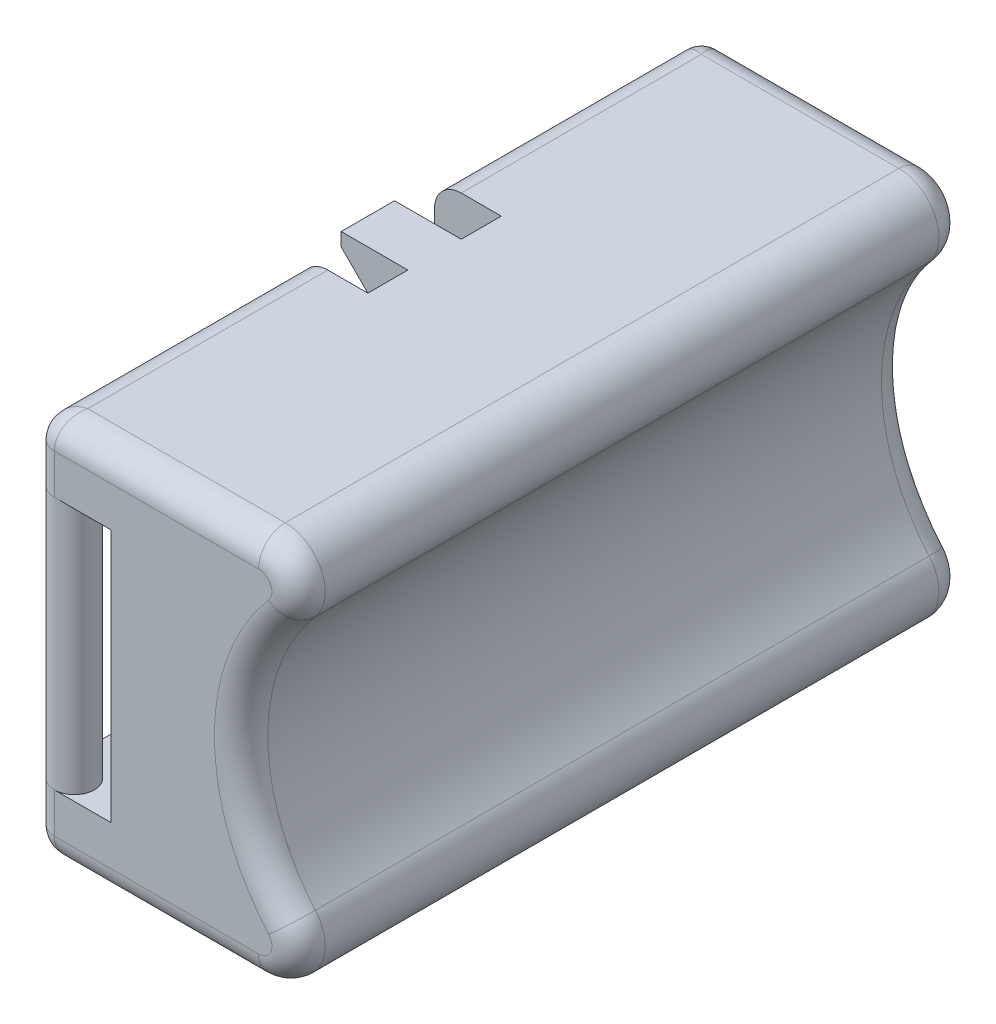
ISO-10303-21;
HEADER;
FILE_DESCRIPTION(('STEP AP214'),'2;1');
FILE_NAME('part.step','',(''),(''),'','','');
FILE_SCHEMA(('AUTOMOTIVE_DESIGN { 1 0 10303 214 1 1 1 1 }'));
ENDSEC;
DATA;
#1=APPLICATION_CONTEXT('core data for automotive mechanical design processes');
#2=APPLICATION_PROTOCOL_DEFINITION('international standard','automotive_design',2000,#1);
#3=PRODUCT_CONTEXT('',#1,'mechanical');
#4=PRODUCT('Part','Part','',(#3));
#5=PRODUCT_RELATED_PRODUCT_CATEGORY('part','',(#4));
#6=PRODUCT_DEFINITION_FORMATION('','',#4);
#7=PRODUCT_DEFINITION_CONTEXT('part definition',#1,'design');
#8=PRODUCT_DEFINITION('design','',#6,#7);
#9=PRODUCT_DEFINITION_SHAPE('','',#8);
#10=(LENGTH_UNIT() NAMED_UNIT(*) SI_UNIT(.MILLI.,.METRE.));
#11=(NAMED_UNIT(*) PLANE_ANGLE_UNIT() SI_UNIT($,.RADIAN.));
#12=(NAMED_UNIT(*) SI_UNIT($,.STERADIAN.) SOLID_ANGLE_UNIT());
#13=UNCERTAINTY_MEASURE_WITH_UNIT(LENGTH_MEASURE(1.E-05),#10,'distance_accuracy_value','');
#14=(GEOMETRIC_REPRESENTATION_CONTEXT(3) GLOBAL_UNCERTAINTY_ASSIGNED_CONTEXT((#13)) GLOBAL_UNIT_ASSIGNED_CONTEXT((#10,
#11,#12)) REPRESENTATION_CONTEXT('',''));
#15=CARTESIAN_POINT('',(0.,0.,0.));
#16=DIRECTION('',(0.,0.,1.));
#17=DIRECTION('',(1.,0.,0.));
#18=AXIS2_PLACEMENT_3D('',#15,#16,#17);
#19=CARTESIAN_POINT('',(-15.,14.5,-25.));
#20=DIRECTION('',(1.,0.,0.));
#21=DIRECTION('',(0.,0.,-1.));
#22=AXIS2_PLACEMENT_3D('',#19,#20,#21);
#23=PLANE('',#22);
#24=DIRECTION('',(0.,-1.,0.));
#25=VECTOR('',#24,1.);
#26=CARTESIAN_POINT('',(-15.,14.5,-23.5));
#27=LINE('',#26,#25);
#28=CARTESIAN_POINT('',(-15.,-9.5,-23.5));
#29=VERTEX_POINT('',#28);
#30=CARTESIAN_POINT('',(-15.,-12.5,-23.5));
#31=VERTEX_POINT('',#30);
#32=EDGE_CURVE('E447',#29,#31,#27,.T.);
#33=ORIENTED_EDGE('',*,*,#32,.T.);
#34=DIRECTION('',(0.,0.,1.));
#35=VECTOR('',#34,1.);
#36=CARTESIAN_POINT('',(-15.,-12.5,-25.));
#37=LINE('',#36,#35);
#38=CARTESIAN_POINT('',(-15.,-12.5,-5.));
#39=VERTEX_POINT('',#38);
#40=EDGE_CURVE('E478',#31,#39,#37,.T.);
#41=ORIENTED_EDGE('',*,*,#40,.T.);
#42=DIRECTION('',(0.,1.,0.));
#43=VECTOR('',#42,1.);
#44=CARTESIAN_POINT('',(-15.,-7.87689437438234,-5.));
#45=LINE('',#44,#43);
#46=CARTESIAN_POINT('',(-15.,-9.5,-5.));
#47=VERTEX_POINT('',#46);
#48=EDGE_CURVE('E339',#39,#47,#45,.T.);
#49=ORIENTED_EDGE('',*,*,#48,.T.);
#50=DIRECTION('',(0.,0.,1.));
#51=VECTOR('',#50,1.);
#52=CARTESIAN_POINT('',(-15.,-9.5,4.99999999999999));
#53=LINE('',#52,#51);
#54=CARTESIAN_POINT('',(-15.,-9.5,5.));
#55=VERTEX_POINT('',#54);
#56=EDGE_CURVE('E363',#47,#55,#53,.T.);
#57=ORIENTED_EDGE('',*,*,#56,.T.);
#58=DIRECTION('',(0.,-1.,0.));
#59=VECTOR('',#58,1.);
#60=CARTESIAN_POINT('',(-15.,-7.87689437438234,5.));
#61=LINE('',#60,#59);
#62=CARTESIAN_POINT('',(-15.,-12.5,5.));
#63=VERTEX_POINT('',#62);
#64=EDGE_CURVE('E360',#55,#63,#61,.T.);
#65=ORIENTED_EDGE('',*,*,#64,.T.);
#66=DIRECTION('',(0.,0.,1.));
#67=VECTOR('',#66,1.);
#68=CARTESIAN_POINT('',(-15.,-12.5,-25.));
#69=LINE('',#68,#67);
#70=CARTESIAN_POINT('',(-15.,-12.5,23.5));
#71=VERTEX_POINT('',#70);
#72=EDGE_CURVE('E472',#63,#71,#69,.T.);
#73=ORIENTED_EDGE('',*,*,#72,.T.);
#74=DIRECTION('',(0.,-1.,0.));
#75=VECTOR('',#74,1.);
#76=CARTESIAN_POINT('',(-15.,14.5,23.5));
#77=LINE('',#76,#75);
#78=CARTESIAN_POINT('',(-15.,-9.5,23.5));
#79=VERTEX_POINT('',#78);
#80=EDGE_CURVE('E453',#71,#79,#77,.F.);
#81=ORIENTED_EDGE('',*,*,#80,.T.);
#82=DIRECTION('',(0.,0.,1.));
#83=VECTOR('',#82,1.);
#84=CARTESIAN_POINT('',(-15.,-9.5,-25.));
#85=LINE('',#84,#83);
#86=CARTESIAN_POINT('',(-15.,-9.5,19.2573593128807));
#87=VERTEX_POINT('',#86);
#88=EDGE_CURVE('E412',#87,#79,#85,.T.);
#89=ORIENTED_EDGE('',*,*,#88,.F.);
#90=DIRECTION('',(0.,1.,0.));
#91=VECTOR('',#90,1.);
#92=CARTESIAN_POINT('',(-15.,-27.2279220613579,19.2573593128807));
#93=LINE('',#92,#91);
#94=CARTESIAN_POINT('',(-15.,9.5,19.2573593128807));
#95=VERTEX_POINT('',#94);
#96=EDGE_CURVE('E418',#87,#95,#93,.T.);
#97=ORIENTED_EDGE('',*,*,#96,.T.);
#98=DIRECTION('',(0.,0.,1.));
#99=VECTOR('',#98,1.);
#100=CARTESIAN_POINT('',(-15.,9.5,-25.));
#101=LINE('',#100,#99);
#102=CARTESIAN_POINT('',(-15.,9.5,23.5));
#103=VERTEX_POINT('',#102);
#104=EDGE_CURVE('E415',#95,#103,#101,.T.);
#105=ORIENTED_EDGE('',*,*,#104,.T.);
#106=DIRECTION('',(0.,-1.,0.));
#107=VECTOR('',#106,1.);
#108=CARTESIAN_POINT('',(-15.,14.5,23.5));
#109=LINE('',#108,#107);
#110=CARTESIAN_POINT('',(-15.,12.5,23.5));
#111=VERTEX_POINT('',#110);
#112=EDGE_CURVE('E450',#103,#111,#109,.F.);
#113=ORIENTED_EDGE('',*,*,#112,.T.);
#114=DIRECTION('',(0.,0.,1.));
#115=VECTOR('',#114,1.);
#116=CARTESIAN_POINT('',(-15.,12.5,5.));
#117=LINE('',#116,#115);
#118=CARTESIAN_POINT('',(-15.,12.5,5.));
#119=VERTEX_POINT('',#118);
#120=EDGE_CURVE('E474',#111,#119,#117,.F.);
#121=ORIENTED_EDGE('',*,*,#120,.T.);
#122=DIRECTION('',(0.,1.,0.));
#123=VECTOR('',#122,1.);
#124=CARTESIAN_POINT('',(-15.,7.87689437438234,5.));
#125=LINE('',#124,#123);
#126=CARTESIAN_POINT('',(-15.,9.5,5.));
#127=VERTEX_POINT('',#126);
#128=EDGE_CURVE('E308',#127,#119,#125,.T.);
#129=ORIENTED_EDGE('',*,*,#128,.F.);
#130=DIRECTION('',(0.,0.,1.));
#131=VECTOR('',#130,1.);
#132=CARTESIAN_POINT('',(-15.,9.5,4.99999999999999));
#133=LINE('',#132,#131);
#134=CARTESIAN_POINT('',(-15.,9.5,-5.));
#135=VERTEX_POINT('',#134);
#136=EDGE_CURVE('E312',#135,#127,#133,.T.);
#137=ORIENTED_EDGE('',*,*,#136,.F.);
#138=DIRECTION('',(0.,-1.,0.));
#139=VECTOR('',#138,1.);
#140=CARTESIAN_POINT('',(-15.,7.87689437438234,-5.));
#141=LINE('',#140,#139);
#142=CARTESIAN_POINT('',(-15.,12.5,-5.));
#143=VERTEX_POINT('',#142);
#144=EDGE_CURVE('E1238',#143,#135,#141,.T.);
#145=ORIENTED_EDGE('',*,*,#144,.F.);
#146=DIRECTION('',(0.,0.,1.));
#147=VECTOR('',#146,1.);
#148=CARTESIAN_POINT('',(-15.,12.5,-23.5));
#149=LINE('',#148,#147);
#150=CARTESIAN_POINT('',(-15.,12.5,-23.5));
#151=VERTEX_POINT('',#150);
#152=EDGE_CURVE('E476',#143,#151,#149,.F.);
#153=ORIENTED_EDGE('',*,*,#152,.T.);
#154=DIRECTION('',(0.,-1.,0.));
#155=VECTOR('',#154,1.);
#156=CARTESIAN_POINT('',(-15.,14.5,-23.5));
#157=LINE('',#156,#155);
#158=CARTESIAN_POINT('',(-15.,9.5,-23.5));
#159=VERTEX_POINT('',#158);
#160=EDGE_CURVE('E445',#151,#159,#157,.T.);
#161=ORIENTED_EDGE('',*,*,#160,.T.);
#162=DIRECTION('',(0.,0.,1.));
#163=VECTOR('',#162,1.);
#164=CARTESIAN_POINT('',(-15.,9.5,-25.));
#165=LINE('',#164,#163);
#166=CARTESIAN_POINT('',(-15.,9.5,-19.2573593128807));
#167=VERTEX_POINT('',#166);
#168=EDGE_CURVE('E395',#159,#167,#165,.T.);
#169=ORIENTED_EDGE('',*,*,#168,.T.);
#170=DIRECTION('',(0.,1.,0.));
#171=VECTOR('',#170,1.);
#172=CARTESIAN_POINT('',(-15.,-27.2279220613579,-19.2573593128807));
#173=LINE('',#172,#171);
#174=CARTESIAN_POINT('',(-15.,-9.5,-19.2573593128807));
#175=VERTEX_POINT('',#174);
#176=EDGE_CURVE('E393',#175,#167,#173,.T.);
#177=ORIENTED_EDGE('',*,*,#176,.F.);
#178=DIRECTION('',(0.,0.,1.));
#179=VECTOR('',#178,1.);
#180=CARTESIAN_POINT('',(-15.,-9.5,-25.));
#181=LINE('',#180,#179);
#182=EDGE_CURVE('E391',#29,#175,#181,.T.);
#183=ORIENTED_EDGE('',*,*,#182,.F.);
#184=EDGE_LOOP('',(#33,#41,#49,#57,#65,#73,#81,#89,#97,#105,#113,#121,#129,#137,#145,#153,#161,
#169,#177,#183));
#185=FACE_BOUND('',#184,.T.);
#186=ADVANCED_FACE('F38',(#185),#23,.F.);
#187=DIRECTION('',(0.,0.,1.));
#188=VECTOR('',#187,1.);
#189=CARTESIAN_POINT('',(-15.,13.5,-6.47213595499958));
#190=LINE('',#189,#188);
#191=CARTESIAN_POINT('',(-15.,13.5,-2.));
#192=VERTEX_POINT('',#191);
#193=CARTESIAN_POINT('',(-15.,13.5,2.));
#194=VERTEX_POINT('',#193);
#195=EDGE_CURVE('E287',#192,#194,#190,.T.);
#196=ORIENTED_EDGE('',*,*,#195,.T.);
#197=DIRECTION('',(0.,-1.,0.));
#198=VECTOR('',#197,1.);
#199=CARTESIAN_POINT('',(-15.,7.87689437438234,2.));
#200=LINE('',#199,#198);
#201=CARTESIAN_POINT('',(-15.,14.5,2.));
#202=VERTEX_POINT('',#201);
#203=EDGE_CURVE('E301',#202,#194,#200,.T.);
#204=ORIENTED_EDGE('',*,*,#203,.F.);
#205=DIRECTION('',(0.,0.,1.));
#206=VECTOR('',#205,1.);
#207=CARTESIAN_POINT('',(-15.,14.5,-25.));
#208=LINE('',#207,#206);
#209=CARTESIAN_POINT('',(-15.,14.5,-2.00000000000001));
#210=VERTEX_POINT('',#209);
#211=EDGE_CURVE('E422',#210,#202,#208,.T.);
#212=ORIENTED_EDGE('',*,*,#211,.F.);
#213=DIRECTION('',(0.,1.,0.));
#214=VECTOR('',#213,1.);
#215=CARTESIAN_POINT('',(-15.,7.87689437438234,-2.));
#216=LINE('',#215,#214);
#217=EDGE_CURVE('E302',#192,#210,#216,.T.);
#218=ORIENTED_EDGE('',*,*,#217,.F.);
#219=EDGE_LOOP('',(#196,#204,#212,#218));
#220=FACE_BOUND('',#219,.T.);
#221=ADVANCED_FACE('F299',(#220),#23,.F.);
#222=CARTESIAN_POINT('',(-16.6231056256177,7.87689437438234,2.));
#223=DIRECTION('',(0.,0.,1.));
#224=DIRECTION('',(1.,0.,0.));
#225=AXIS2_PLACEMENT_3D('',#222,#223,#224);
#226=PLANE('',#225);
#227=ORIENTED_EDGE('',*,*,#203,.T.);
#228=DIRECTION('',(0.707106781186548,-0.707106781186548,0.));
#229=VECTOR('',#228,1.);
#230=CARTESIAN_POINT('',(-13.,11.5,2.));
#231=LINE('',#230,#229);
#232=CARTESIAN_POINT('',(-13.,11.5,2.));
#233=VERTEX_POINT('',#232);
#234=EDGE_CURVE('E284',#194,#233,#231,.T.);
#235=ORIENTED_EDGE('',*,*,#234,.T.);
#236=DIRECTION('',(0.707106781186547,0.707106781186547,0.));
#237=VECTOR('',#236,1.);
#238=CARTESIAN_POINT('',(-16.6231056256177,7.87689437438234,2.));
#239=LINE('',#238,#237);
#240=CARTESIAN_POINT('',(-10.,14.5,2.));
#241=VERTEX_POINT('',#240);
#242=EDGE_CURVE('E314',#233,#241,#239,.T.);
#243=ORIENTED_EDGE('',*,*,#242,.T.);
#244=DIRECTION('',(1.,0.,0.));
#245=VECTOR('',#244,1.);
#246=CARTESIAN_POINT('',(-10.,14.5,2.));
#247=LINE('',#246,#245);
#248=EDGE_CURVE('E307',#202,#241,#247,.T.);
#249=ORIENTED_EDGE('',*,*,#248,.F.);
#250=EDGE_LOOP('',(#227,#235,#243,#249));
#251=FACE_BOUND('',#250,.T.);
#252=ADVANCED_FACE('F305',(#251),#226,.T.);
#253=CARTESIAN_POINT('',(-16.6231056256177,7.87689437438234,-2.));
#254=DIRECTION('',(0.,0.,-1.));
#255=DIRECTION('',(-1.,0.,0.));
#256=AXIS2_PLACEMENT_3D('',#253,#254,#255);
#257=PLANE('',#256);
#258=DIRECTION('',(0.707106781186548,0.707106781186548,0.));
#259=VECTOR('',#258,1.);
#260=CARTESIAN_POINT('',(-16.6231056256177,7.87689437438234,-2.));
#261=LINE('',#260,#259);
#262=CARTESIAN_POINT('',(-13.,11.5,-2.));
#263=VERTEX_POINT('',#262);
#264=CARTESIAN_POINT('',(-10.,14.5,-2.));
#265=VERTEX_POINT('',#264);
#266=EDGE_CURVE('E317',#263,#265,#261,.T.);
#267=ORIENTED_EDGE('',*,*,#266,.F.);
#268=DIRECTION('',(-0.707106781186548,0.707106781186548,0.));
#269=VECTOR('',#268,1.);
#270=CARTESIAN_POINT('',(-13.,11.5,-2.));
#271=LINE('',#270,#269);
#272=EDGE_CURVE('E1253',#263,#192,#271,.T.);
#273=ORIENTED_EDGE('',*,*,#272,.T.);
#274=ORIENTED_EDGE('',*,*,#217,.T.);
#275=DIRECTION('',(-1.,0.,0.));
#276=VECTOR('',#275,1.);
#277=CARTESIAN_POINT('',(-10.,14.5,-2.));
#278=LINE('',#277,#276);
#279=EDGE_CURVE('E1250',#265,#210,#278,.T.);
#280=ORIENTED_EDGE('',*,*,#279,.F.);
#281=EDGE_LOOP('',(#267,#273,#274,#280));
#282=FACE_BOUND('',#281,.T.);
#283=ADVANCED_FACE('F666',(#282),#257,.T.);
#284=CARTESIAN_POINT('',(0.,14.5,0.));
#285=DIRECTION('',(0.,1.,0.));
#286=DIRECTION('',(0.,0.,1.));
#287=AXIS2_PLACEMENT_3D('',#284,#285,#286);
#288=PLANE('',#287);
#289=DIRECTION('',(-1.,0.,0.));
#290=VECTOR('',#289,1.);
#291=CARTESIAN_POINT('',(-10.,14.5,5.));
#292=LINE('',#291,#290);
#293=CARTESIAN_POINT('',(-10.,14.5,5.));
#294=VERTEX_POINT('',#293);
#295=CARTESIAN_POINT('',(-13.,14.5,5.));
#296=VERTEX_POINT('',#295);
#297=EDGE_CURVE('E324',#294,#296,#292,.T.);
#298=ORIENTED_EDGE('',*,*,#297,.T.);
#299=DIRECTION('',(0.,0.,1.));
#300=VECTOR('',#299,1.);
#301=CARTESIAN_POINT('',(-13.,14.5,23.5));
#302=LINE('',#301,#300);
#303=CARTESIAN_POINT('',(-13.,14.5,23.));
#304=VERTEX_POINT('',#303);
#305=EDGE_CURVE('E521',#296,#304,#302,.T.);
#306=ORIENTED_EDGE('',*,*,#305,.T.);
#307=DIRECTION('',(1.,0.,0.));
#308=VECTOR('',#307,1.);
#309=CARTESIAN_POINT('',(1.80909404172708,14.5,23.));
#310=LINE('',#309,#308);
#311=CARTESIAN_POINT('',(1.80909404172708,14.5,23.));
#312=VERTEX_POINT('',#311);
#313=EDGE_CURVE('E519',#304,#312,#310,.T.);
#314=ORIENTED_EDGE('',*,*,#313,.T.);
#315=DIRECTION('',(0.,0.,-1.));
#316=VECTOR('',#315,1.);
#317=CARTESIAN_POINT('',(1.80909404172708,14.5,-25.));
#318=LINE('',#317,#316);
#319=CARTESIAN_POINT('',(1.80909404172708,14.5,-23.));
#320=VERTEX_POINT('',#319);
#321=EDGE_CURVE('E469',#312,#320,#318,.T.);
#322=ORIENTED_EDGE('',*,*,#321,.T.);
#323=DIRECTION('',(-1.,0.,0.));
#324=VECTOR('',#323,1.);
#325=CARTESIAN_POINT('',(-13.5,14.5,-23.));
#326=LINE('',#325,#324);
#327=CARTESIAN_POINT('',(-13.,14.5,-23.));
#328=VERTEX_POINT('',#327);
#329=EDGE_CURVE('E515',#320,#328,#326,.T.);
#330=ORIENTED_EDGE('',*,*,#329,.T.);
#331=DIRECTION('',(0.,0.,1.));
#332=VECTOR('',#331,1.);
#333=CARTESIAN_POINT('',(-13.,14.5,-5.));
#334=LINE('',#333,#332);
#335=CARTESIAN_POINT('',(-13.,14.5,-5.));
#336=VERTEX_POINT('',#335);
#337=EDGE_CURVE('E517',#328,#336,#334,.T.);
#338=ORIENTED_EDGE('',*,*,#337,.T.);
#339=DIRECTION('',(1.,0.,0.));
#340=VECTOR('',#339,1.);
#341=CARTESIAN_POINT('',(-10.,14.5,-5.));
#342=LINE('',#341,#340);
#343=CARTESIAN_POINT('',(-10.,14.5,-5.));
#344=VERTEX_POINT('',#343);
#345=EDGE_CURVE('E1246',#336,#344,#342,.T.);
#346=ORIENTED_EDGE('',*,*,#345,.T.);
#347=DIRECTION('',(0.,0.,1.));
#348=VECTOR('',#347,1.);
#349=CARTESIAN_POINT('',(-10.,14.5,-2.));
#350=LINE('',#349,#348);
#351=EDGE_CURVE('E1243',#344,#265,#350,.T.);
#352=ORIENTED_EDGE('',*,*,#351,.T.);
#353=ORIENTED_EDGE('',*,*,#279,.T.);
#354=ORIENTED_EDGE('',*,*,#211,.T.);
#355=ORIENTED_EDGE('',*,*,#248,.T.);
#356=DIRECTION('',(0.,0.,1.));
#357=VECTOR('',#356,1.);
#358=CARTESIAN_POINT('',(-10.,14.5,5.));
#359=LINE('',#358,#357);
#360=EDGE_CURVE('E320',#241,#294,#359,.T.);
#361=ORIENTED_EDGE('',*,*,#360,.T.);
#362=EDGE_LOOP('',(#298,#306,#314,#322,#330,#338,#346,#352,#353,#354,#355,#361));
#363=FACE_BOUND('',#362,.T.);
#364=ADVANCED_FACE('F659',(#363),#288,.T.);
#365=DIRECTION('',(0.,1.,0.));
#366=VECTOR('',#365,1.);
#367=CARTESIAN_POINT('',(-15.,-7.87689437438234,2.));
#368=LINE('',#367,#366);
#369=CARTESIAN_POINT('',(-15.,-14.5,2.));
#370=VERTEX_POINT('',#369);
#371=CARTESIAN_POINT('',(-15.,-13.5,2.));
#372=VERTEX_POINT('',#371);
#373=EDGE_CURVE('E356',#370,#372,#368,.T.);
#374=ORIENTED_EDGE('',*,*,#373,.T.);
#375=DIRECTION('',(0.,0.,1.));
#376=VECTOR('',#375,1.);
#377=CARTESIAN_POINT('',(-15.,-13.5,-6.47213595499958));
#378=LINE('',#377,#376);
#379=CARTESIAN_POINT('',(-15.,-13.5,-2.));
#380=VERTEX_POINT('',#379);
#381=EDGE_CURVE('E333',#380,#372,#378,.T.);
#382=ORIENTED_EDGE('',*,*,#381,.F.);
#383=DIRECTION('',(0.,-1.,0.));
#384=VECTOR('',#383,1.);
#385=CARTESIAN_POINT('',(-15.,-7.87689437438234,-2.));
#386=LINE('',#385,#384);
#387=CARTESIAN_POINT('',(-15.,-14.5,-2.));
#388=VERTEX_POINT('',#387);
#389=EDGE_CURVE('E341',#380,#388,#386,.T.);
#390=ORIENTED_EDGE('',*,*,#389,.T.);
#391=DIRECTION('',(0.,0.,1.));
#392=VECTOR('',#391,1.);
#393=CARTESIAN_POINT('',(-15.,-14.5,-25.));
#394=LINE('',#393,#392);
#395=EDGE_CURVE('E421',#388,#370,#394,.T.);
#396=ORIENTED_EDGE('',*,*,#395,.T.);
#397=EDGE_LOOP('',(#374,#382,#390,#396));
#398=FACE_BOUND('',#397,.T.);
#399=ADVANCED_FACE('F651',(#398),#23,.F.);
#400=CARTESIAN_POINT('',(-15.,14.5,25.));
#401=DIRECTION('',(0.,0.,-1.));
#402=DIRECTION('',(-1.,0.,0.));
#403=AXIS2_PLACEMENT_3D('',#400,#401,#402);
#404=PLANE('',#403);
#405=CARTESIAN_POINT('',(1.80909404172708,11.5,25.));
#406=DIRECTION('',(0.,0.,-1.));
#407=DIRECTION('',(-1.,0.,0.));
#408=AXIS2_PLACEMENT_3D('',#405,#406,#407);
#409=CIRCLE('',#408,1.);
#410=CARTESIAN_POINT('',(2.56286009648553,10.8428571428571,25.));
#411=VERTEX_POINT('',#410);
#412=CARTESIAN_POINT('',(1.80909404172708,12.5,25.));
#413=VERTEX_POINT('',#412);
#414=EDGE_CURVE('E56',#411,#413,#409,.F.);
#415=ORIENTED_EDGE('',*,*,#414,.T.);
#416=DIRECTION('',(1.,0.,0.));
#417=VECTOR('',#416,1.);
#418=CARTESIAN_POINT('',(-13.5,12.5,25.));
#419=LINE('',#418,#417);
#420=CARTESIAN_POINT('',(-13.5,12.5,25.));
#421=VERTEX_POINT('',#420);
#422=EDGE_CURVE('E538',#413,#421,#419,.F.);
#423=ORIENTED_EDGE('',*,*,#422,.T.);
#424=DIRECTION('',(0.,-1.,0.));
#425=VECTOR('',#424,1.);
#426=CARTESIAN_POINT('',(-13.5,14.5,25.));
#427=LINE('',#426,#425);
#428=CARTESIAN_POINT('',(-13.5,9.5,25.));
#429=VERTEX_POINT('',#428);
#430=EDGE_CURVE('E441',#421,#429,#427,.T.);
#431=ORIENTED_EDGE('',*,*,#430,.T.);
#432=DIRECTION('',(1.,0.,0.));
#433=VECTOR('',#432,1.);
#434=CARTESIAN_POINT('',(-15.,9.5,25.));
#435=LINE('',#434,#433);
#436=CARTESIAN_POINT('',(-9.25735931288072,9.5,25.));
#437=VERTEX_POINT('',#436);
#438=EDGE_CURVE('E430',#429,#437,#435,.T.);
#439=ORIENTED_EDGE('',*,*,#438,.T.);
#440=DIRECTION('',(0.,1.,0.));
#441=VECTOR('',#440,1.);
#442=CARTESIAN_POINT('',(-9.25735931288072,-27.2279220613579,25.));
#443=LINE('',#442,#441);
#444=CARTESIAN_POINT('',(-9.25735931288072,-9.5,25.));
#445=VERTEX_POINT('',#444);
#446=EDGE_CURVE('E427',#437,#445,#443,.F.);
#447=ORIENTED_EDGE('',*,*,#446,.T.);
#448=DIRECTION('',(1.,0.,0.));
#449=VECTOR('',#448,1.);
#450=CARTESIAN_POINT('',(-15.,-9.5,25.));
#451=LINE('',#450,#449);
#452=CARTESIAN_POINT('',(-13.5,-9.5,25.));
#453=VERTEX_POINT('',#452);
#454=EDGE_CURVE('E424',#453,#445,#451,.T.);
#455=ORIENTED_EDGE('',*,*,#454,.F.);
#456=DIRECTION('',(0.,-1.,0.));
#457=VECTOR('',#456,1.);
#458=CARTESIAN_POINT('',(-13.5,14.5,25.));
#459=LINE('',#458,#457);
#460=CARTESIAN_POINT('',(-13.5,-12.5,25.));
#461=VERTEX_POINT('',#460);
#462=EDGE_CURVE('E443',#453,#461,#459,.T.);
#463=ORIENTED_EDGE('',*,*,#462,.T.);
#464=DIRECTION('',(1.,0.,0.));
#465=VECTOR('',#464,1.);
#466=CARTESIAN_POINT('',(-15.,-12.5,25.));
#467=LINE('',#466,#465);
#468=CARTESIAN_POINT('',(1.80909404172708,-12.5,25.));
#469=VERTEX_POINT('',#468);
#470=EDGE_CURVE('E63',#461,#469,#467,.T.);
#471=ORIENTED_EDGE('',*,*,#470,.T.);
#472=CARTESIAN_POINT('',(1.80909404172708,-11.5,25.));
#473=DIRECTION('',(0.,0.,-1.));
#474=DIRECTION('',(-1.,0.,0.));
#475=AXIS2_PLACEMENT_3D('',#472,#473,#474);
#476=CIRCLE('',#475,1.);
#477=CARTESIAN_POINT('',(2.56286009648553,-10.8428571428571,25.));
#478=VERTEX_POINT('',#477);
#479=EDGE_CURVE('E534',#469,#478,#476,.F.);
#480=ORIENTED_EDGE('',*,*,#479,.T.);
#481=CARTESIAN_POINT('',(15.,0.,25.));
#482=DIRECTION('',(0.,0.,-1.));
#483=DIRECTION('',(-1.,0.,0.));
#484=AXIS2_PLACEMENT_3D('',#481,#482,#483);
#485=CIRCLE('',#484,16.5);
#486=EDGE_CURVE('E532',#478,#411,#485,.T.);
#487=ORIENTED_EDGE('',*,*,#486,.T.);
#488=EDGE_LOOP('',(#415,#423,#431,#439,#447,#455,#463,#471,#480,#487));
#489=FACE_BOUND('',#488,.T.);
#490=ADVANCED_FACE('F658',(#489),#404,.F.);
#491=CARTESIAN_POINT('',(-15.,14.5,-25.));
#492=DIRECTION('',(0.,0.,1.));
#493=DIRECTION('',(1.,0.,0.));
#494=AXIS2_PLACEMENT_3D('',#491,#492,#493);
#495=PLANE('',#494);
#496=CARTESIAN_POINT('',(1.80909404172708,-11.5,-25.));
#497=DIRECTION('',(0.,0.,1.));
#498=DIRECTION('',(1.,0.,0.));
#499=AXIS2_PLACEMENT_3D('',#496,#497,#498);
#500=CIRCLE('',#499,1.);
#501=CARTESIAN_POINT('',(2.56286009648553,-10.8428571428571,-25.));
#502=VERTEX_POINT('',#501);
#503=CARTESIAN_POINT('',(1.80909404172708,-12.5,-25.));
#504=VERTEX_POINT('',#503);
#505=EDGE_CURVE('E499',#502,#504,#500,.F.);
#506=ORIENTED_EDGE('',*,*,#505,.T.);
#507=DIRECTION('',(-1.,0.,0.));
#508=VECTOR('',#507,1.);
#509=CARTESIAN_POINT('',(-15.,-12.5,-25.));
#510=LINE('',#509,#508);
#511=CARTESIAN_POINT('',(-13.5,-12.5,-25.));
#512=VERTEX_POINT('',#511);
#513=EDGE_CURVE('E501',#504,#512,#510,.T.);
#514=ORIENTED_EDGE('',*,*,#513,.T.);
#515=DIRECTION('',(0.,-1.,0.));
#516=VECTOR('',#515,1.);
#517=CARTESIAN_POINT('',(-13.5,14.5,-25.));
#518=LINE('',#517,#516);
#519=CARTESIAN_POINT('',(-13.5,-9.5,-25.));
#520=VERTEX_POINT('',#519);
#521=EDGE_CURVE('E458',#512,#520,#518,.F.);
#522=ORIENTED_EDGE('',*,*,#521,.T.);
#523=DIRECTION('',(-1.,0.,0.));
#524=VECTOR('',#523,1.);
#525=CARTESIAN_POINT('',(-15.,-9.5,-25.));
#526=LINE('',#525,#524);
#527=CARTESIAN_POINT('',(-9.25735931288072,-9.5,-25.));
#528=VERTEX_POINT('',#527);
#529=EDGE_CURVE('E433',#528,#520,#526,.T.);
#530=ORIENTED_EDGE('',*,*,#529,.F.);
#531=DIRECTION('',(0.,1.,0.));
#532=VECTOR('',#531,1.);
#533=CARTESIAN_POINT('',(-9.25735931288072,-27.2279220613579,-25.));
#534=LINE('',#533,#532);
#535=CARTESIAN_POINT('',(-9.25735931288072,9.5,-25.));
#536=VERTEX_POINT('',#535);
#537=EDGE_CURVE('E436',#536,#528,#534,.F.);
#538=ORIENTED_EDGE('',*,*,#537,.F.);
#539=DIRECTION('',(-1.,0.,0.));
#540=VECTOR('',#539,1.);
#541=CARTESIAN_POINT('',(-15.,9.5,-25.));
#542=LINE('',#541,#540);
#543=CARTESIAN_POINT('',(-13.5,9.5,-25.));
#544=VERTEX_POINT('',#543);
#545=EDGE_CURVE('E438',#536,#544,#542,.T.);
#546=ORIENTED_EDGE('',*,*,#545,.T.);
#547=DIRECTION('',(0.,-1.,0.));
#548=VECTOR('',#547,1.);
#549=CARTESIAN_POINT('',(-13.5,14.5,-25.));
#550=LINE('',#549,#548);
#551=CARTESIAN_POINT('',(-13.5,12.5,-25.));
#552=VERTEX_POINT('',#551);
#553=EDGE_CURVE('E455',#544,#552,#550,.F.);
#554=ORIENTED_EDGE('',*,*,#553,.T.);
#555=DIRECTION('',(-1.,0.,0.));
#556=VECTOR('',#555,1.);
#557=CARTESIAN_POINT('',(1.80909404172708,12.5,-25.));
#558=LINE('',#557,#556);
#559=CARTESIAN_POINT('',(1.80909404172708,12.5,-25.));
#560=VERTEX_POINT('',#559);
#561=EDGE_CURVE('E493',#552,#560,#558,.F.);
#562=ORIENTED_EDGE('',*,*,#561,.T.);
#563=CARTESIAN_POINT('',(1.80909404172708,11.5,-25.));
#564=DIRECTION('',(0.,0.,1.));
#565=DIRECTION('',(1.,0.,0.));
#566=AXIS2_PLACEMENT_3D('',#563,#564,#565);
#567=CIRCLE('',#566,1.);
#568=CARTESIAN_POINT('',(2.56286009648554,10.8428571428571,-25.));
#569=VERTEX_POINT('',#568);
#570=EDGE_CURVE('E495',#560,#569,#567,.F.);
#571=ORIENTED_EDGE('',*,*,#570,.T.);
#572=CARTESIAN_POINT('',(15.,0.,-25.));
#573=DIRECTION('',(0.,0.,1.));
#574=DIRECTION('',(1.,0.,0.));
#575=AXIS2_PLACEMENT_3D('',#572,#573,#574);
#576=CIRCLE('',#575,16.5);
#577=EDGE_CURVE('E497',#569,#502,#576,.T.);
#578=ORIENTED_EDGE('',*,*,#577,.T.);
#579=EDGE_LOOP('',(#506,#514,#522,#530,#538,#546,#554,#562,#571,#578));
#580=FACE_BOUND('',#579,.T.);
#581=ADVANCED_FACE('F665',(#580),#495,.F.);
#582=CARTESIAN_POINT('',(0.,-14.5,0.));
#583=DIRECTION('',(0.,1.,0.));
#584=DIRECTION('',(0.,0.,1.));
#585=AXIS2_PLACEMENT_3D('',#582,#583,#584);
#586=PLANE('',#585);
#587=DIRECTION('',(1.,0.,0.));
#588=VECTOR('',#587,1.);
#589=CARTESIAN_POINT('',(-10.,-14.5,-5.));
#590=LINE('',#589,#588);
#591=CARTESIAN_POINT('',(-13.,-14.5,-5.));
#592=VERTEX_POINT('',#591);
#593=CARTESIAN_POINT('',(-10.,-14.5,-5.));
#594=VERTEX_POINT('',#593);
#595=EDGE_CURVE('E332',#592,#594,#590,.T.);
#596=ORIENTED_EDGE('',*,*,#595,.F.);
#597=DIRECTION('',(0.,0.,1.));
#598=VECTOR('',#597,1.);
#599=CARTESIAN_POINT('',(-13.,-14.5,0.));
#600=LINE('',#599,#598);
#601=CARTESIAN_POINT('',(-13.,-14.5,-23.));
#602=VERTEX_POINT('',#601);
#603=EDGE_CURVE('E489',#592,#602,#600,.F.);
#604=ORIENTED_EDGE('',*,*,#603,.T.);
#605=DIRECTION('',(-1.,0.,0.));
#606=VECTOR('',#605,1.);
#607=CARTESIAN_POINT('',(0.,-14.5,-23.));
#608=LINE('',#607,#606);
#609=CARTESIAN_POINT('',(1.80909404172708,-14.5,-23.));
#610=VERTEX_POINT('',#609);
#611=EDGE_CURVE('E487',#602,#610,#608,.F.);
#612=ORIENTED_EDGE('',*,*,#611,.T.);
#613=DIRECTION('',(0.,0.,1.));
#614=VECTOR('',#613,1.);
#615=CARTESIAN_POINT('',(1.80909404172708,-14.5,0.));
#616=LINE('',#615,#614);
#617=CARTESIAN_POINT('',(1.80909404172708,-14.5,23.));
#618=VERTEX_POINT('',#617);
#619=EDGE_CURVE('E466',#610,#618,#616,.T.);
#620=ORIENTED_EDGE('',*,*,#619,.T.);
#621=DIRECTION('',(1.,0.,0.));
#622=VECTOR('',#621,1.);
#623=CARTESIAN_POINT('',(0.,-14.5,23.));
#624=LINE('',#623,#622);
#625=CARTESIAN_POINT('',(-13.,-14.5,23.));
#626=VERTEX_POINT('',#625);
#627=EDGE_CURVE('E483',#618,#626,#624,.F.);
#628=ORIENTED_EDGE('',*,*,#627,.T.);
#629=DIRECTION('',(0.,0.,1.));
#630=VECTOR('',#629,1.);
#631=CARTESIAN_POINT('',(-13.,-14.5,0.));
#632=LINE('',#631,#630);
#633=CARTESIAN_POINT('',(-13.,-14.5,5.));
#634=VERTEX_POINT('',#633);
#635=EDGE_CURVE('E485',#626,#634,#632,.F.);
#636=ORIENTED_EDGE('',*,*,#635,.T.);
#637=DIRECTION('',(-1.,0.,0.));
#638=VECTOR('',#637,1.);
#639=CARTESIAN_POINT('',(-10.,-14.5,5.));
#640=LINE('',#639,#638);
#641=CARTESIAN_POINT('',(-10.,-14.5,5.));
#642=VERTEX_POINT('',#641);
#643=EDGE_CURVE('E365',#642,#634,#640,.T.);
#644=ORIENTED_EDGE('',*,*,#643,.F.);
#645=DIRECTION('',(0.,0.,1.));
#646=VECTOR('',#645,1.);
#647=CARTESIAN_POINT('',(-10.,-14.5,5.));
#648=LINE('',#647,#646);
#649=CARTESIAN_POINT('',(-10.,-14.5,2.));
#650=VERTEX_POINT('',#649);
#651=EDGE_CURVE('E344',#650,#642,#648,.T.);
#652=ORIENTED_EDGE('',*,*,#651,.F.);
#653=DIRECTION('',(1.,0.,0.));
#654=VECTOR('',#653,1.);
#655=CARTESIAN_POINT('',(-10.,-14.5,2.));
#656=LINE('',#655,#654);
#657=EDGE_CURVE('E368',#370,#650,#656,.T.);
#658=ORIENTED_EDGE('',*,*,#657,.F.);
#659=ORIENTED_EDGE('',*,*,#395,.F.);
#660=DIRECTION('',(-1.,0.,0.));
#661=VECTOR('',#660,1.);
#662=CARTESIAN_POINT('',(-10.,-14.5,-2.));
#663=LINE('',#662,#661);
#664=CARTESIAN_POINT('',(-10.,-14.5,-2.));
#665=VERTEX_POINT('',#664);
#666=EDGE_CURVE('E349',#665,#388,#663,.T.);
#667=ORIENTED_EDGE('',*,*,#666,.F.);
#668=DIRECTION('',(0.,0.,1.));
#669=VECTOR('',#668,1.);
#670=CARTESIAN_POINT('',(-10.,-14.5,-2.));
#671=LINE('',#670,#669);
#672=EDGE_CURVE('E346',#594,#665,#671,.T.);
#673=ORIENTED_EDGE('',*,*,#672,.F.);
#674=EDGE_LOOP('',(#596,#604,#612,#620,#628,#636,#644,#652,#658,#659,#667,#673));
#675=FACE_BOUND('',#674,.T.);
#676=ADVANCED_FACE('F681',(#675),#586,.F.);
#677=CARTESIAN_POINT('',(-13.5,-27.2279220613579,23.5));
#678=DIRECTION('',(0.,1.,0.));
#679=DIRECTION('',(0.,0.,1.));
#680=AXIS2_PLACEMENT_3D('',#677,#678,#679);
#681=CYLINDRICAL_SURFACE('',#680,4.5);
#682=CARTESIAN_POINT('',(-13.5,-9.5,23.5));
#683=DIRECTION('',(0.,1.,0.));
#684=DIRECTION('',(0.,0.,1.));
#685=AXIS2_PLACEMENT_3D('',#682,#683,#684);
#686=CIRCLE('',#685,4.5);
#687=EDGE_CURVE('E399',#87,#445,#686,.F.);
#688=ORIENTED_EDGE('',*,*,#687,.T.);
#689=ORIENTED_EDGE('',*,*,#446,.F.);
#690=CARTESIAN_POINT('',(-13.5,9.5,23.5));
#691=DIRECTION('',(0.,1.,0.));
#692=DIRECTION('',(0.,0.,1.));
#693=AXIS2_PLACEMENT_3D('',#690,#691,#692);
#694=CIRCLE('',#693,4.5);
#695=EDGE_CURVE('E403',#437,#95,#694,.T.);
#696=ORIENTED_EDGE('',*,*,#695,.T.);
#697=ORIENTED_EDGE('',*,*,#96,.F.);
#698=EDGE_LOOP('',(#688,#689,#696,#697));
#699=FACE_BOUND('',#698,.T.);
#700=ADVANCED_FACE('F710',(#699),#681,.F.);
#701=CARTESIAN_POINT('',(-13.5,9.5,23.5));
#702=DIRECTION('',(0.,1.,0.));
#703=DIRECTION('',(0.,0.,1.));
#704=AXIS2_PLACEMENT_3D('',#701,#702,#703);
#705=PLANE('',#704);
#706=ORIENTED_EDGE('',*,*,#695,.F.);
#707=ORIENTED_EDGE('',*,*,#438,.F.);
#708=CARTESIAN_POINT('',(-13.5,9.5,23.5));
#709=DIRECTION('',(0.,1.,0.));
#710=DIRECTION('',(0.,0.,1.));
#711=AXIS2_PLACEMENT_3D('',#708,#709,#710);
#712=CIRCLE('',#711,1.5);
#713=EDGE_CURVE('E404',#429,#103,#712,.T.);
#714=ORIENTED_EDGE('',*,*,#713,.T.);
#715=ORIENTED_EDGE('',*,*,#104,.F.);
#716=EDGE_LOOP('',(#706,#707,#714,#715));
#717=FACE_BOUND('',#716,.T.);
#718=ADVANCED_FACE('F716',(#717),#705,.F.);
#719=CARTESIAN_POINT('',(-13.5,-27.2279220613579,23.5));
#720=DIRECTION('',(0.,1.,0.));
#721=DIRECTION('',(0.,0.,1.));
#722=AXIS2_PLACEMENT_3D('',#719,#720,#721);
#723=CYLINDRICAL_SURFACE('',#722,1.5);
#724=EDGE_CURVE('E398',#103,#429,#712,.T.);
#725=ORIENTED_EDGE('',*,*,#724,.F.);
#726=ORIENTED_EDGE('',*,*,#713,.F.);
#727=EDGE_LOOP('',(#725,#726));
#728=FACE_BOUND('',#727,.T.);
#729=CARTESIAN_POINT('',(-13.5,-9.5,23.5));
#730=DIRECTION('',(0.,1.,0.));
#731=DIRECTION('',(0.,0.,1.));
#732=AXIS2_PLACEMENT_3D('',#729,#730,#731);
#733=CIRCLE('',#732,1.5);
#734=EDGE_CURVE('E402',#79,#453,#733,.F.);
#735=ORIENTED_EDGE('',*,*,#734,.F.);
#736=EDGE_CURVE('E409',#453,#79,#733,.F.);
#737=ORIENTED_EDGE('',*,*,#736,.F.);
#738=EDGE_LOOP('',(#735,#737));
#739=FACE_BOUND('',#738,.T.);
#740=ADVANCED_FACE('F714',(#728,#739),#723,.T.);
#741=CARTESIAN_POINT('',(0.,-9.5,0.));
#742=DIRECTION('',(0.,1.,0.));
#743=DIRECTION('',(0.,0.,1.));
#744=AXIS2_PLACEMENT_3D('',#741,#742,#743);
#745=PLANE('',#744);
#746=ORIENTED_EDGE('',*,*,#88,.T.);
#747=ORIENTED_EDGE('',*,*,#734,.T.);
#748=ORIENTED_EDGE('',*,*,#454,.T.);
#749=ORIENTED_EDGE('',*,*,#687,.F.);
#750=EDGE_LOOP('',(#746,#747,#748,#749));
#751=FACE_BOUND('',#750,.T.);
#752=ADVANCED_FACE('F706',(#751),#745,.T.);
#753=CARTESIAN_POINT('',(-13.5,9.5,-23.5));
#754=DIRECTION('',(0.,1.,0.));
#755=DIRECTION('',(0.,0.,-1.));
#756=AXIS2_PLACEMENT_3D('',#753,#754,#755);
#757=PLANE('',#756);
#758=CARTESIAN_POINT('',(-13.5,9.5,-23.5));
#759=DIRECTION('',(0.,-1.,0.));
#760=DIRECTION('',(0.,0.,-1.));
#761=AXIS2_PLACEMENT_3D('',#758,#759,#760);
#762=CIRCLE('',#761,1.5);
#763=EDGE_CURVE('E383',#544,#159,#762,.T.);
#764=ORIENTED_EDGE('',*,*,#763,.F.);
#765=ORIENTED_EDGE('',*,*,#545,.F.);
#766=CARTESIAN_POINT('',(-13.5,9.5,-23.5));
#767=DIRECTION('',(0.,-1.,0.));
#768=DIRECTION('',(0.,0.,-1.));
#769=AXIS2_PLACEMENT_3D('',#766,#767,#768);
#770=CIRCLE('',#769,4.5);
#771=EDGE_CURVE('E378',#536,#167,#770,.T.);
#772=ORIENTED_EDGE('',*,*,#771,.T.);
#773=ORIENTED_EDGE('',*,*,#168,.F.);
#774=EDGE_LOOP('',(#764,#765,#772,#773));
#775=FACE_BOUND('',#774,.T.);
#776=ADVANCED_FACE('F723',(#775),#757,.F.);
#777=CARTESIAN_POINT('',(-13.5,-27.2279220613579,-23.5));
#778=DIRECTION('',(0.,1.,0.));
#779=DIRECTION('',(0.,0.,1.));
#780=AXIS2_PLACEMENT_3D('',#777,#778,#779);
#781=CYLINDRICAL_SURFACE('',#780,4.5);
#782=ORIENTED_EDGE('',*,*,#176,.T.);
#783=ORIENTED_EDGE('',*,*,#771,.F.);
#784=ORIENTED_EDGE('',*,*,#537,.T.);
#785=CARTESIAN_POINT('',(-13.5,-9.5,-23.5));
#786=DIRECTION('',(0.,1.,0.));
#787=DIRECTION('',(0.,0.,1.));
#788=AXIS2_PLACEMENT_3D('',#785,#786,#787);
#789=CIRCLE('',#788,4.5);
#790=EDGE_CURVE('E382',#175,#528,#789,.T.);
#791=ORIENTED_EDGE('',*,*,#790,.F.);
#792=EDGE_LOOP('',(#782,#783,#784,#791));
#793=FACE_BOUND('',#792,.T.);
#794=ADVANCED_FACE('F765',(#793),#781,.F.);
#795=CARTESIAN_POINT('',(-13.5,-27.2279220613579,-23.5));
#796=DIRECTION('',(0.,1.,0.));
#797=DIRECTION('',(0.,0.,1.));
#798=AXIS2_PLACEMENT_3D('',#795,#796,#797);
#799=CYLINDRICAL_SURFACE('',#798,1.5);
#800=CARTESIAN_POINT('',(-13.5,-9.5,-23.5));
#801=DIRECTION('',(0.,1.,0.));
#802=DIRECTION('',(0.,0.,1.));
#803=AXIS2_PLACEMENT_3D('',#800,#801,#802);
#804=CIRCLE('',#803,1.5);
#805=EDGE_CURVE('E388',#520,#29,#804,.T.);
#806=ORIENTED_EDGE('',*,*,#805,.T.);
#807=EDGE_CURVE('E381',#29,#520,#804,.T.);
#808=ORIENTED_EDGE('',*,*,#807,.T.);
#809=EDGE_LOOP('',(#806,#808));
#810=FACE_BOUND('',#809,.T.);
#811=EDGE_CURVE('E359',#159,#544,#762,.T.);
#812=ORIENTED_EDGE('',*,*,#811,.T.);
#813=ORIENTED_EDGE('',*,*,#763,.T.);
#814=EDGE_LOOP('',(#812,#813));
#815=FACE_BOUND('',#814,.T.);
#816=ADVANCED_FACE('F770',(#810,#815),#799,.T.);
#817=CARTESIAN_POINT('',(0.,-9.5,0.));
#818=DIRECTION('',(0.,1.,0.));
#819=DIRECTION('',(0.,0.,1.));
#820=AXIS2_PLACEMENT_3D('',#817,#818,#819);
#821=PLANE('',#820);
#822=ORIENTED_EDGE('',*,*,#182,.T.);
#823=ORIENTED_EDGE('',*,*,#790,.T.);
#824=ORIENTED_EDGE('',*,*,#529,.T.);
#825=ORIENTED_EDGE('',*,*,#807,.F.);
#826=EDGE_LOOP('',(#822,#823,#824,#825));
#827=FACE_BOUND('',#826,.T.);
#828=ADVANCED_FACE('F761',(#827),#821,.T.);
#829=CARTESIAN_POINT('',(-13.5,14.5,23.5));
#830=DIRECTION('',(0.,-1.,0.));
#831=DIRECTION('',(0.,0.,-1.));
#832=AXIS2_PLACEMENT_3D('',#829,#830,#831);
#833=CYLINDRICAL_SURFACE('',#832,1.5);
#834=ORIENTED_EDGE('',*,*,#80,.F.);
#835=CARTESIAN_POINT('',(-13.5,-12.5,23.5));
#836=DIRECTION('',(0.,1.,0.));
#837=DIRECTION('',(0.,0.,1.));
#838=AXIS2_PLACEMENT_3D('',#835,#836,#837);
#839=CIRCLE('',#838,1.5);
#840=EDGE_CURVE('E12',#71,#461,#839,.T.);
#841=ORIENTED_EDGE('',*,*,#840,.T.);
#842=ORIENTED_EDGE('',*,*,#462,.F.);
#843=ORIENTED_EDGE('',*,*,#736,.T.);
#844=EDGE_LOOP('',(#834,#841,#842,#843));
#845=FACE_BOUND('',#844,.T.);
#846=ADVANCED_FACE('F701',(#845),#833,.T.);
#847=CARTESIAN_POINT('',(-13.5,14.5,23.5));
#848=DIRECTION('',(0.,-1.,0.));
#849=DIRECTION('',(0.,0.,-1.));
#850=AXIS2_PLACEMENT_3D('',#847,#848,#849);
#851=CYLINDRICAL_SURFACE('',#850,1.5);
#852=ORIENTED_EDGE('',*,*,#430,.F.);
#853=CARTESIAN_POINT('',(-13.5,12.5,23.5));
#854=DIRECTION('',(0.,-1.,0.));
#855=DIRECTION('',(0.,0.,-1.));
#856=AXIS2_PLACEMENT_3D('',#853,#854,#855);
#857=CIRCLE('',#856,1.5);
#858=EDGE_CURVE('E530',#421,#111,#857,.T.);
#859=ORIENTED_EDGE('',*,*,#858,.T.);
#860=ORIENTED_EDGE('',*,*,#112,.F.);
#861=ORIENTED_EDGE('',*,*,#724,.T.);
#862=EDGE_LOOP('',(#852,#859,#860,#861));
#863=FACE_BOUND('',#862,.T.);
#864=ADVANCED_FACE('F878',(#863),#851,.T.);
#865=CARTESIAN_POINT('',(-13.5,14.5,-23.5));
#866=DIRECTION('',(0.,-1.,0.));
#867=DIRECTION('',(0.,0.,-1.));
#868=AXIS2_PLACEMENT_3D('',#865,#866,#867);
#869=CYLINDRICAL_SURFACE('',#868,1.5);
#870=ORIENTED_EDGE('',*,*,#521,.F.);
#871=CARTESIAN_POINT('',(-13.5,-12.5,-23.5));
#872=DIRECTION('',(0.,1.,0.));
#873=DIRECTION('',(0.,0.,1.));
#874=AXIS2_PLACEMENT_3D('',#871,#872,#873);
#875=CIRCLE('',#874,1.5);
#876=EDGE_CURVE('E491',#512,#31,#875,.T.);
#877=ORIENTED_EDGE('',*,*,#876,.T.);
#878=ORIENTED_EDGE('',*,*,#32,.F.);
#879=ORIENTED_EDGE('',*,*,#805,.F.);
#880=EDGE_LOOP('',(#870,#877,#878,#879));
#881=FACE_BOUND('',#880,.T.);
#882=ADVANCED_FACE('F754',(#881),#869,.T.);
#883=CARTESIAN_POINT('',(-13.5,14.5,-23.5));
#884=DIRECTION('',(0.,-1.,0.));
#885=DIRECTION('',(0.,0.,-1.));
#886=AXIS2_PLACEMENT_3D('',#883,#884,#885);
#887=CYLINDRICAL_SURFACE('',#886,1.5);
#888=ORIENTED_EDGE('',*,*,#160,.F.);
#889=CARTESIAN_POINT('',(-13.5,12.5,-23.5));
#890=DIRECTION('',(0.,-1.,0.));
#891=DIRECTION('',(0.,0.,-1.));
#892=AXIS2_PLACEMENT_3D('',#889,#890,#891);
#893=CIRCLE('',#892,1.5);
#894=EDGE_CURVE('E526',#151,#552,#893,.T.);
#895=ORIENTED_EDGE('',*,*,#894,.T.);
#896=ORIENTED_EDGE('',*,*,#553,.F.);
#897=ORIENTED_EDGE('',*,*,#811,.F.);
#898=EDGE_LOOP('',(#888,#895,#896,#897));
#899=FACE_BOUND('',#898,.T.);
#900=ADVANCED_FACE('F783',(#899),#887,.T.);
#901=CARTESIAN_POINT('',(15.,0.,-25.));
#902=DIRECTION('',(0.,0.,1.));
#903=DIRECTION('',(1.,0.,0.));
#904=AXIS2_PLACEMENT_3D('',#901,#902,#903);
#905=CYLINDRICAL_SURFACE('',#904,14.5);
#906=DIRECTION('',(0.,0.,1.));
#907=VECTOR('',#906,1.);
#908=CARTESIAN_POINT('',(4.07039220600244,-9.52857142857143,-25.));
#909=LINE('',#908,#907);
#910=CARTESIAN_POINT('',(4.07039220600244,-9.52857142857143,23.));
#911=VERTEX_POINT('',#910);
#912=CARTESIAN_POINT('',(4.07039220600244,-9.52857142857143,-23.));
#913=VERTEX_POINT('',#912);
#914=EDGE_CURVE('E463',#911,#913,#909,.F.);
#915=ORIENTED_EDGE('',*,*,#914,.T.);
#916=CARTESIAN_POINT('',(15.,0.,-23.));
#917=DIRECTION('',(0.,0.,1.));
#918=DIRECTION('',(1.,0.,0.));
#919=AXIS2_PLACEMENT_3D('',#916,#917,#918);
#920=CIRCLE('',#919,14.5);
#921=CARTESIAN_POINT('',(4.07039220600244,9.52857142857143,-23.));
#922=VERTEX_POINT('',#921);
#923=EDGE_CURVE('E509',#913,#922,#920,.F.);
#924=ORIENTED_EDGE('',*,*,#923,.T.);
#925=DIRECTION('',(0.,0.,1.));
#926=VECTOR('',#925,1.);
#927=CARTESIAN_POINT('',(4.07039220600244,9.52857142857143,-25.));
#928=LINE('',#927,#926);
#929=CARTESIAN_POINT('',(4.07039220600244,9.52857142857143,23.));
#930=VERTEX_POINT('',#929);
#931=EDGE_CURVE('E460',#922,#930,#928,.T.);
#932=ORIENTED_EDGE('',*,*,#931,.T.);
#933=CARTESIAN_POINT('',(15.,0.,23.));
#934=DIRECTION('',(0.,0.,-1.));
#935=DIRECTION('',(-1.,0.,0.));
#936=AXIS2_PLACEMENT_3D('',#933,#934,#935);
#937=CIRCLE('',#936,14.5);
#938=EDGE_CURVE('E507',#930,#911,#937,.F.);
#939=ORIENTED_EDGE('',*,*,#938,.T.);
#940=EDGE_LOOP('',(#915,#924,#932,#939));
#941=FACE_BOUND('',#940,.T.);
#942=ADVANCED_FACE('F807',(#941),#905,.F.);
#943=CARTESIAN_POINT('',(1.80909404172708,-11.5,-25.));
#944=DIRECTION('',(0.,0.,1.));
#945=DIRECTION('',(1.,0.,0.));
#946=AXIS2_PLACEMENT_3D('',#943,#944,#945);
#947=CYLINDRICAL_SURFACE('',#946,3.);
#948=ORIENTED_EDGE('',*,*,#619,.F.);
#949=CARTESIAN_POINT('',(1.80909404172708,-11.5,-23.));
#950=DIRECTION('',(0.,0.,1.));
#951=DIRECTION('',(1.,0.,0.));
#952=AXIS2_PLACEMENT_3D('',#949,#950,#951);
#953=CIRCLE('',#952,3.);
#954=EDGE_CURVE('E505',#610,#913,#953,.T.);
#955=ORIENTED_EDGE('',*,*,#954,.T.);
#956=ORIENTED_EDGE('',*,*,#914,.F.);
#957=CARTESIAN_POINT('',(1.80909404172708,-11.5,23.));
#958=DIRECTION('',(0.,0.,-1.));
#959=DIRECTION('',(-1.,0.,0.));
#960=AXIS2_PLACEMENT_3D('',#957,#958,#959);
#961=CIRCLE('',#960,3.);
#962=EDGE_CURVE('E503',#911,#618,#961,.T.);
#963=ORIENTED_EDGE('',*,*,#962,.T.);
#964=EDGE_LOOP('',(#948,#955,#956,#963));
#965=FACE_BOUND('',#964,.T.);
#966=ADVANCED_FACE('F835',(#965),#947,.T.);
#967=CARTESIAN_POINT('',(1.80909404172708,11.5,-25.));
#968=DIRECTION('',(0.,0.,1.));
#969=DIRECTION('',(1.,0.,0.));
#970=AXIS2_PLACEMENT_3D('',#967,#968,#969);
#971=CYLINDRICAL_SURFACE('',#970,3.);
#972=ORIENTED_EDGE('',*,*,#931,.F.);
#973=CARTESIAN_POINT('',(1.80909404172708,11.5,-23.));
#974=DIRECTION('',(0.,0.,1.));
#975=DIRECTION('',(1.,0.,0.));
#976=AXIS2_PLACEMENT_3D('',#973,#974,#975);
#977=CIRCLE('',#976,3.);
#978=EDGE_CURVE('E513',#922,#320,#977,.T.);
#979=ORIENTED_EDGE('',*,*,#978,.T.);
#980=ORIENTED_EDGE('',*,*,#321,.F.);
#981=CARTESIAN_POINT('',(1.80909404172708,11.5,23.));
#982=DIRECTION('',(0.,0.,-1.));
#983=DIRECTION('',(-1.,0.,0.));
#984=AXIS2_PLACEMENT_3D('',#981,#982,#983);
#985=CIRCLE('',#984,3.);
#986=EDGE_CURVE('E511',#312,#930,#985,.T.);
#987=ORIENTED_EDGE('',*,*,#986,.T.);
#988=EDGE_LOOP('',(#972,#979,#980,#987));
#989=FACE_BOUND('',#988,.T.);
#990=ADVANCED_FACE('F811',(#989),#971,.T.);
#991=CARTESIAN_POINT('',(-16.6231056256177,-7.87689437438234,5.));
#992=DIRECTION('',(0.707106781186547,0.707106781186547,0.));
#993=DIRECTION('',(-0.707106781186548,0.707106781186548,0.));
#994=AXIS2_PLACEMENT_3D('',#991,#992,#993);
#995=PLANE('',#994);
#996=ORIENTED_EDGE('',*,*,#56,.F.);
#997=DIRECTION('',(0.707106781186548,-0.707106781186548,0.));
#998=VECTOR('',#997,1.);
#999=CARTESIAN_POINT('',(-16.6231056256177,-7.87689437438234,-5.));
#1000=LINE('',#999,#998);
#1001=EDGE_CURVE('E352',#47,#594,#1000,.T.);
#1002=ORIENTED_EDGE('',*,*,#1001,.T.);
#1003=ORIENTED_EDGE('',*,*,#672,.T.);
#1004=DIRECTION('',(0.707106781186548,-0.707106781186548,0.));
#1005=VECTOR('',#1004,1.);
#1006=CARTESIAN_POINT('',(-16.6231056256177,-7.87689437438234,-2.));
#1007=LINE('',#1006,#1005);
#1008=CARTESIAN_POINT('',(-13.,-11.5,-2.));
#1009=VERTEX_POINT('',#1008);
#1010=EDGE_CURVE('E342',#1009,#665,#1007,.T.);
#1011=ORIENTED_EDGE('',*,*,#1010,.F.);
#1012=DIRECTION('',(0.,0.,1.));
#1013=VECTOR('',#1012,1.);
#1014=CARTESIAN_POINT('',(-13.,-11.5,-6.47213595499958));
#1015=LINE('',#1014,#1013);
#1016=CARTESIAN_POINT('',(-13.,-11.5,2.));
#1017=VERTEX_POINT('',#1016);
#1018=EDGE_CURVE('E336',#1009,#1017,#1015,.T.);
#1019=ORIENTED_EDGE('',*,*,#1018,.T.);
#1020=DIRECTION('',(0.707106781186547,-0.707106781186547,0.));
#1021=VECTOR('',#1020,1.);
#1022=CARTESIAN_POINT('',(-16.6231056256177,-7.87689437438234,2.));
#1023=LINE('',#1022,#1021);
#1024=EDGE_CURVE('E372',#1017,#650,#1023,.T.);
#1025=ORIENTED_EDGE('',*,*,#1024,.T.);
#1026=ORIENTED_EDGE('',*,*,#651,.T.);
#1027=DIRECTION('',(0.707106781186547,-0.707106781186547,0.));
#1028=VECTOR('',#1027,1.);
#1029=CARTESIAN_POINT('',(-16.6231056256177,-7.87689437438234,5.));
#1030=LINE('',#1029,#1028);
#1031=EDGE_CURVE('E371',#55,#642,#1030,.T.);
#1032=ORIENTED_EDGE('',*,*,#1031,.F.);
#1033=EDGE_LOOP('',(#996,#1002,#1003,#1011,#1019,#1025,#1026,#1032));
#1034=FACE_BOUND('',#1033,.T.);
#1035=ADVANCED_FACE('F687',(#1034),#995,.F.);
#1036=CARTESIAN_POINT('',(-16.6231056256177,-7.87689437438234,2.));
#1037=DIRECTION('',(0.,0.,-1.));
#1038=DIRECTION('',(-1.,0.,0.));
#1039=AXIS2_PLACEMENT_3D('',#1036,#1037,#1038);
#1040=PLANE('',#1039);
#1041=ORIENTED_EDGE('',*,*,#1024,.F.);
#1042=DIRECTION('',(0.707106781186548,0.707106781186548,0.));
#1043=VECTOR('',#1042,1.);
#1044=CARTESIAN_POINT('',(-13.,-11.5,2.));
#1045=LINE('',#1044,#1043);
#1046=EDGE_CURVE('E329',#372,#1017,#1045,.T.);
#1047=ORIENTED_EDGE('',*,*,#1046,.F.);
#1048=ORIENTED_EDGE('',*,*,#373,.F.);
#1049=ORIENTED_EDGE('',*,*,#657,.T.);
#1050=EDGE_LOOP('',(#1041,#1047,#1048,#1049));
#1051=FACE_BOUND('',#1050,.T.);
#1052=ADVANCED_FACE('F677',(#1051),#1040,.F.);
#1053=CARTESIAN_POINT('',(-16.6231056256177,-7.87689437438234,5.));
#1054=DIRECTION('',(0.,0.,1.));
#1055=DIRECTION('',(1.,0.,0.));
#1056=AXIS2_PLACEMENT_3D('',#1053,#1054,#1055);
#1057=PLANE('',#1056);
#1058=ORIENTED_EDGE('',*,*,#643,.T.);
#1059=CARTESIAN_POINT('',(-13.,-12.5,5.));
#1060=DIRECTION('',(0.,0.,1.));
#1061=DIRECTION('',(1.,0.,0.));
#1062=AXIS2_PLACEMENT_3D('',#1059,#1060,#1061);
#1063=CIRCLE('',#1062,2.);
#1064=EDGE_CURVE('E48',#634,#63,#1063,.F.);
#1065=ORIENTED_EDGE('',*,*,#1064,.T.);
#1066=ORIENTED_EDGE('',*,*,#64,.F.);
#1067=ORIENTED_EDGE('',*,*,#1031,.T.);
#1068=EDGE_LOOP('',(#1058,#1065,#1066,#1067));
#1069=FACE_BOUND('',#1068,.T.);
#1070=ADVANCED_FACE('F689',(#1069),#1057,.F.);
#1071=CARTESIAN_POINT('',(-16.6231056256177,-7.87689437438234,-5.));
#1072=DIRECTION('',(0.,0.,-1.));
#1073=DIRECTION('',(-1.,0.,0.));
#1074=AXIS2_PLACEMENT_3D('',#1071,#1072,#1073);
#1075=PLANE('',#1074);
#1076=ORIENTED_EDGE('',*,*,#48,.F.);
#1077=CARTESIAN_POINT('',(-13.,-12.5,-5.));
#1078=DIRECTION('',(0.,0.,-1.));
#1079=DIRECTION('',(-1.,0.,0.));
#1080=AXIS2_PLACEMENT_3D('',#1077,#1078,#1079);
#1081=CIRCLE('',#1080,2.);
#1082=EDGE_CURVE('E481',#39,#592,#1081,.F.);
#1083=ORIENTED_EDGE('',*,*,#1082,.T.);
#1084=ORIENTED_EDGE('',*,*,#595,.T.);
#1085=ORIENTED_EDGE('',*,*,#1001,.F.);
#1086=EDGE_LOOP('',(#1076,#1083,#1084,#1085));
#1087=FACE_BOUND('',#1086,.T.);
#1088=ADVANCED_FACE('F840',(#1087),#1075,.F.);
#1089=CARTESIAN_POINT('',(-16.6231056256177,-7.87689437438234,-2.));
#1090=DIRECTION('',(0.,0.,1.));
#1091=DIRECTION('',(1.,0.,0.));
#1092=AXIS2_PLACEMENT_3D('',#1089,#1090,#1091);
#1093=PLANE('',#1092);
#1094=ORIENTED_EDGE('',*,*,#389,.F.);
#1095=DIRECTION('',(-0.707106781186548,-0.707106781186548,0.));
#1096=VECTOR('',#1095,1.);
#1097=CARTESIAN_POINT('',(-13.,-11.5,-2.));
#1098=LINE('',#1097,#1096);
#1099=EDGE_CURVE('E330',#1009,#380,#1098,.T.);
#1100=ORIENTED_EDGE('',*,*,#1099,.F.);
#1101=ORIENTED_EDGE('',*,*,#1010,.T.);
#1102=ORIENTED_EDGE('',*,*,#666,.T.);
#1103=EDGE_LOOP('',(#1094,#1100,#1101,#1102));
#1104=FACE_BOUND('',#1103,.T.);
#1105=ADVANCED_FACE('F844',(#1104),#1093,.F.);
#1106=CARTESIAN_POINT('',(-13.,-11.5,-6.47213595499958));
#1107=DIRECTION('',(0.707106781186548,-0.707106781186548,0.));
#1108=DIRECTION('',(0.707106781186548,0.707106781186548,0.));
#1109=AXIS2_PLACEMENT_3D('',#1106,#1107,#1108);
#1110=PLANE('',#1109);
#1111=ORIENTED_EDGE('',*,*,#1099,.T.);
#1112=ORIENTED_EDGE('',*,*,#381,.T.);
#1113=ORIENTED_EDGE('',*,*,#1046,.T.);
#1114=ORIENTED_EDGE('',*,*,#1018,.F.);
#1115=EDGE_LOOP('',(#1111,#1112,#1113,#1114));
#1116=FACE_BOUND('',#1115,.T.);
#1117=ADVANCED_FACE('F847',(#1116),#1110,.F.);
#1118=CARTESIAN_POINT('',(-16.6231056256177,7.87689437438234,5.));
#1119=DIRECTION('',(-0.707106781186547,0.707106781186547,0.));
#1120=DIRECTION('',(-0.707106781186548,-0.707106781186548,0.));
#1121=AXIS2_PLACEMENT_3D('',#1118,#1119,#1120);
#1122=PLANE('',#1121);
#1123=ORIENTED_EDGE('',*,*,#136,.T.);
#1124=DIRECTION('',(0.707106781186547,0.707106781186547,0.));
#1125=VECTOR('',#1124,1.);
#1126=CARTESIAN_POINT('',(-16.6231056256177,7.87689437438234,5.));
#1127=LINE('',#1126,#1125);
#1128=EDGE_CURVE('E309',#127,#294,#1127,.T.);
#1129=ORIENTED_EDGE('',*,*,#1128,.T.);
#1130=ORIENTED_EDGE('',*,*,#360,.F.);
#1131=ORIENTED_EDGE('',*,*,#242,.F.);
#1132=DIRECTION('',(0.,0.,1.));
#1133=VECTOR('',#1132,1.);
#1134=CARTESIAN_POINT('',(-13.,11.5,-6.47213595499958));
#1135=LINE('',#1134,#1133);
#1136=EDGE_CURVE('E290',#263,#233,#1135,.T.);
#1137=ORIENTED_EDGE('',*,*,#1136,.F.);
#1138=ORIENTED_EDGE('',*,*,#266,.T.);
#1139=ORIENTED_EDGE('',*,*,#351,.F.);
#1140=DIRECTION('',(0.707106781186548,0.707106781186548,0.));
#1141=VECTOR('',#1140,1.);
#1142=CARTESIAN_POINT('',(-16.6231056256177,7.87689437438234,-5.));
#1143=LINE('',#1142,#1141);
#1144=EDGE_CURVE('E1241',#135,#344,#1143,.T.);
#1145=ORIENTED_EDGE('',*,*,#1144,.F.);
#1146=EDGE_LOOP('',(#1123,#1129,#1130,#1131,#1137,#1138,#1139,#1145));
#1147=FACE_BOUND('',#1146,.T.);
#1148=ADVANCED_FACE('F849',(#1147),#1122,.T.);
#1149=CARTESIAN_POINT('',(-16.6231056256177,7.87689437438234,5.));
#1150=DIRECTION('',(0.,0.,-1.));
#1151=DIRECTION('',(-1.,0.,0.));
#1152=AXIS2_PLACEMENT_3D('',#1149,#1150,#1151);
#1153=PLANE('',#1152);
#1154=ORIENTED_EDGE('',*,*,#128,.T.);
#1155=CARTESIAN_POINT('',(-13.,12.5,5.));
#1156=DIRECTION('',(0.,0.,-1.));
#1157=DIRECTION('',(-1.,0.,0.));
#1158=AXIS2_PLACEMENT_3D('',#1155,#1156,#1157);
#1159=CIRCLE('',#1158,2.);
#1160=EDGE_CURVE('E528',#119,#296,#1159,.T.);
#1161=ORIENTED_EDGE('',*,*,#1160,.T.);
#1162=ORIENTED_EDGE('',*,*,#297,.F.);
#1163=ORIENTED_EDGE('',*,*,#1128,.F.);
#1164=EDGE_LOOP('',(#1154,#1161,#1162,#1163));
#1165=FACE_BOUND('',#1164,.T.);
#1166=ADVANCED_FACE('F855',(#1165),#1153,.T.);
#1167=CARTESIAN_POINT('',(-16.6231056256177,7.87689437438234,-5.));
#1168=DIRECTION('',(0.,0.,1.));
#1169=DIRECTION('',(1.,0.,0.));
#1170=AXIS2_PLACEMENT_3D('',#1167,#1168,#1169);
#1171=PLANE('',#1170);
#1172=ORIENTED_EDGE('',*,*,#345,.F.);
#1173=CARTESIAN_POINT('',(-13.,12.5,-5.));
#1174=DIRECTION('',(0.,0.,1.));
#1175=DIRECTION('',(1.,0.,0.));
#1176=AXIS2_PLACEMENT_3D('',#1173,#1174,#1175);
#1177=CIRCLE('',#1176,2.);
#1178=EDGE_CURVE('E524',#336,#143,#1177,.T.);
#1179=ORIENTED_EDGE('',*,*,#1178,.T.);
#1180=ORIENTED_EDGE('',*,*,#144,.T.);
#1181=ORIENTED_EDGE('',*,*,#1144,.T.);
#1182=EDGE_LOOP('',(#1172,#1179,#1180,#1181));
#1183=FACE_BOUND('',#1182,.T.);
#1184=ADVANCED_FACE('F962',(#1183),#1171,.T.);
#1185=CARTESIAN_POINT('',(-13.,11.5,-6.47213595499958));
#1186=DIRECTION('',(-0.707106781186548,-0.707106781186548,0.));
#1187=DIRECTION('',(0.707106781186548,-0.707106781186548,0.));
#1188=AXIS2_PLACEMENT_3D('',#1185,#1186,#1187);
#1189=PLANE('',#1188);
#1190=ORIENTED_EDGE('',*,*,#1136,.T.);
#1191=ORIENTED_EDGE('',*,*,#234,.F.);
#1192=ORIENTED_EDGE('',*,*,#195,.F.);
#1193=ORIENTED_EDGE('',*,*,#272,.F.);
#1194=EDGE_LOOP('',(#1190,#1191,#1192,#1193));
#1195=FACE_BOUND('',#1194,.T.);
#1196=ADVANCED_FACE('F286',(#1195),#1189,.T.);
#1197=CARTESIAN_POINT('',(-13.,12.5,0.));
#1198=DIRECTION('',(0.,0.,-1.));
#1199=DIRECTION('',(-1.,0.,0.));
#1200=AXIS2_PLACEMENT_3D('',#1197,#1198,#1199);
#1201=CYLINDRICAL_SURFACE('',#1200,2.);
#1202=ORIENTED_EDGE('',*,*,#1178,.F.);
#1203=ORIENTED_EDGE('',*,*,#337,.F.);
#1204=CARTESIAN_POINT('',(-13.,12.5,-23.));
#1205=DIRECTION('',(-0.242535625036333,0.,0.970142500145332));
#1206=DIRECTION('',(-0.970142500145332,0.,-0.242535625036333));
#1207=AXIS2_PLACEMENT_3D('',#1204,#1205,#1206);
#1208=ELLIPSE('',#1207,2.06155281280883,2.);
#1209=EDGE_CURVE('E294',#151,#328,#1208,.F.);
#1210=ORIENTED_EDGE('',*,*,#1209,.F.);
#1211=ORIENTED_EDGE('',*,*,#152,.F.);
#1212=EDGE_LOOP('',(#1202,#1203,#1210,#1211));
#1213=FACE_BOUND('',#1212,.T.);
#1214=ADVANCED_FACE('F591',(#1213),#1201,.T.);
#1215=CARTESIAN_POINT('',(-13.,10.5,-23.));
#1216=CARTESIAN_POINT('',(-13.,10.5,-23.));
#1217=CARTESIAN_POINT('',(-13.,10.5,-23.));
#1218=CARTESIAN_POINT('',(-13.0871294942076,10.50003505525,-23.0217823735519));
#1219=CARTESIAN_POINT('',(-13.0544658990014,10.5000690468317,-23.0544658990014));
#1220=CARTESIAN_POINT('',(-13.0217823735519,10.50003505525,-23.0871294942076));
#1221=CARTESIAN_POINT('',(-13.1742812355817,10.5056964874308,-23.0435703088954));
#1222=CARTESIAN_POINT('',(-13.1090831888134,10.5014301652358,-23.1090831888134));
#1223=CARTESIAN_POINT('',(-13.0435703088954,10.5056964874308,-23.1742812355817));
#1224=CARTESIAN_POINT('',(-13.3470859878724,10.5284270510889,-23.0867714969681));
#1225=CARTESIAN_POINT('',(-13.2187583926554,10.5072274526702,-23.2187583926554));
#1226=CARTESIAN_POINT('',(-13.0867714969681,10.5284270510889,-23.3470859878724));
#1227=CARTESIAN_POINT('',(-13.4327454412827,10.5453988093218,-23.1081863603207));
#1228=CARTESIAN_POINT('',(-13.274125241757,10.5116712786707,-23.274125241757));
#1229=CARTESIAN_POINT('',(-13.1081863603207,10.5453988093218,-23.4327454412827));
#1230=CARTESIAN_POINT('',(-13.6011068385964,10.5905163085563,-23.1502767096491));
#1231=CARTESIAN_POINT('',(-13.3860602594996,10.5241695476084,-23.3860602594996));
#1232=CARTESIAN_POINT('',(-13.1502767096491,10.5905163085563,-23.6011068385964));
#1233=CARTESIAN_POINT('',(-13.6838342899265,10.6184698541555,-23.1709585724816));
#1234=CARTESIAN_POINT('',(-13.4429333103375,10.532238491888,-23.4429333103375));
#1235=CARTESIAN_POINT('',(-13.1709585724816,10.6184698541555,-23.6838342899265));
#1236=CARTESIAN_POINT('',(-13.8448909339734,10.6851800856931,-23.2112227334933));
#1237=CARTESIAN_POINT('',(-13.5586469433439,10.5531731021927,-23.5586469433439));
#1238=CARTESIAN_POINT('',(-13.2112227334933,10.6851800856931,-23.8448909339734));
#1239=CARTESIAN_POINT('',(-13.9232782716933,10.7236536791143,-23.2308195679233));
#1240=CARTESIAN_POINT('',(-13.6177814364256,10.5660552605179,-23.6177814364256));
#1241=CARTESIAN_POINT('',(-13.2308195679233,10.7236536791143,-23.9232782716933));
#1242=CARTESIAN_POINT('',(-14.0742796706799,10.8108347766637,-23.26856991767));
#1243=CARTESIAN_POINT('',(-13.7387097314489,10.5985144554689,-23.7387097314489));
#1244=CARTESIAN_POINT('',(-13.26856991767,10.8108347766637,-24.0742796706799));
#1245=CARTESIAN_POINT('',(-14.1469980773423,10.8591775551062,-23.2867495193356));
#1246=CARTESIAN_POINT('',(-13.8007763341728,10.6181008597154,-23.8007763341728));
#1247=CARTESIAN_POINT('',(-13.2867495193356,10.8591775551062,-24.1469980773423));
#1248=CARTESIAN_POINT('',(-14.2853681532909,10.9653530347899,-23.3213420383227));
#1249=CARTESIAN_POINT('',(-13.9279910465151,10.6668542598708,-23.9279910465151));
#1250=CARTESIAN_POINT('',(-13.3213420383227,10.9653530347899,-24.2853681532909));
#1251=CARTESIAN_POINT('',(-14.3511833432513,11.0227553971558,-23.3377958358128));
#1252=CARTESIAN_POINT('',(-13.9933740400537,10.6960042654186,-23.9933740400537));
#1253=CARTESIAN_POINT('',(-13.3377958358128,11.0227553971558,-24.3511833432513));
#1254=CARTESIAN_POINT('',(-14.4745585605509,11.1461322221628,-23.3686396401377));
#1255=CARTESIAN_POINT('',(-14.12698019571,10.7679416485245,-24.12698019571));
#1256=CARTESIAN_POINT('',(-13.3686396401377,11.1461322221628,-24.4745585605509));
#1257=CARTESIAN_POINT('',(-14.532350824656,11.2116373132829,-23.383087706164));
#1258=CARTESIAN_POINT('',(-14.1953761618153,10.8106493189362,-24.1953761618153));
#1259=CARTESIAN_POINT('',(-13.383087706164,11.2116373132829,-24.532350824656));
#1260=CARTESIAN_POINT('',(-14.6386193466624,11.350132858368,-23.4096548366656));
#1261=CARTESIAN_POINT('',(-14.3334466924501,10.9148354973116,-24.33344669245));
#1262=CARTESIAN_POINT('',(-13.4096548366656,11.350132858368,-24.6386193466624));
#1263=CARTESIAN_POINT('',(-14.6873975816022,11.4226545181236,-23.4218493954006));
#1264=CARTESIAN_POINT('',(-14.4032025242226,10.9761079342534,-24.4032025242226));
#1265=CARTESIAN_POINT('',(-13.4218493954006,11.4226545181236,-24.6873975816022));
#1266=CARTESIAN_POINT('',(-14.7747319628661,11.5739295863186,-23.4436829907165));
#1267=CARTESIAN_POINT('',(-14.5402611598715,11.1227975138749,-24.5402611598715));
#1268=CARTESIAN_POINT('',(-13.4436829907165,11.5739295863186,-24.7747319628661));
#1269=CARTESIAN_POINT('',(-14.8136444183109,11.6522663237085,-23.4534111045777));
#1270=CARTESIAN_POINT('',(-14.6075290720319,11.2077837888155,-24.6075290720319));
#1271=CARTESIAN_POINT('',(-13.4534111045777,11.6522663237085,-24.8136444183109));
#1272=CARTESIAN_POINT('',(-14.8805305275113,11.8137569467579,-23.4701326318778));
#1273=CARTESIAN_POINT('',(-14.7331106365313,11.4054280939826,-24.7331106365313));
#1274=CARTESIAN_POINT('',(-13.4701326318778,11.8137569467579,-24.8805305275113));
#1275=CARTESIAN_POINT('',(-14.9088745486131,11.8965997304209,-23.4772186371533));
#1276=CARTESIAN_POINT('',(-14.7912758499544,11.5173079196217,-24.7912758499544));
#1277=CARTESIAN_POINT('',(-13.4772186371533,11.8965997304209,-24.9088745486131));
#1278=CARTESIAN_POINT('',(-14.9541388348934,12.0655489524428,-23.4885347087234));
#1279=CARTESIAN_POINT('',(-14.8900061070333,11.7672033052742,-24.8900061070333));
#1280=CARTESIAN_POINT('',(-13.4885347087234,12.0655489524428,-24.9541388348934));
#1281=CARTESIAN_POINT('',(-14.9713765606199,12.1514827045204,-23.492844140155));
#1282=CARTESIAN_POINT('',(-14.9303663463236,11.9040016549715,-24.9303663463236));
#1283=CARTESIAN_POINT('',(-13.492844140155,12.1514827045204,-24.9713765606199));
#1284=CARTESIAN_POINT('',(-14.9942139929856,12.3249775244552,-23.4985534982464));
#1285=CARTESIAN_POINT('',(-14.9854388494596,12.1946471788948,-24.9854388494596));
#1286=CARTESIAN_POINT('',(-13.4985534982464,12.3249775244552,-24.9942139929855));
#1287=CARTESIAN_POINT('',(-15.,12.4124887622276,-23.5));
#1288=CARTESIAN_POINT('',(-15.,12.3468780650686,-25.));
#1289=CARTESIAN_POINT('',(-13.5,12.4124887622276,-25.));
#1290=CARTESIAN_POINT('',(-15.,12.5875112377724,-23.5));
#1291=CARTESIAN_POINT('',(-15.,12.6531219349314,-25.));
#1292=CARTESIAN_POINT('',(-13.5,12.5875112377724,-25.));
#1293=CARTESIAN_POINT('',(-14.9942139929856,12.6750224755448,-23.4985534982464));
#1294=CARTESIAN_POINT('',(-14.9854388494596,12.8053528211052,-24.9854388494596));
#1295=CARTESIAN_POINT('',(-13.4985534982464,12.6750224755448,-24.9942139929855));
#1296=CARTESIAN_POINT('',(-14.9713765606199,12.8485172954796,-23.492844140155));
#1297=CARTESIAN_POINT('',(-14.9303663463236,13.0959983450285,-24.9303663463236));
#1298=CARTESIAN_POINT('',(-13.492844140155,12.8485172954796,-24.9713765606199));
#1299=CARTESIAN_POINT('',(-14.9541388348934,12.9344510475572,-23.4885347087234));
#1300=CARTESIAN_POINT('',(-14.8900061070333,13.2327966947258,-24.8900061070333));
#1301=CARTESIAN_POINT('',(-13.4885347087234,12.9344510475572,-24.9541388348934));
#1302=CARTESIAN_POINT('',(-14.9088745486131,13.1034002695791,-23.4772186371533));
#1303=CARTESIAN_POINT('',(-14.7912758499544,13.4826920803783,-24.7912758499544));
#1304=CARTESIAN_POINT('',(-13.4772186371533,13.1034002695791,-24.9088745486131));
#1305=CARTESIAN_POINT('',(-14.8805305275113,13.1862430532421,-23.4701326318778));
#1306=CARTESIAN_POINT('',(-14.7331106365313,13.5945719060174,-24.7331106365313));
#1307=CARTESIAN_POINT('',(-13.4701326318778,13.1862430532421,-24.8805305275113));
#1308=CARTESIAN_POINT('',(-14.8136444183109,13.3477336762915,-23.4534111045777));
#1309=CARTESIAN_POINT('',(-14.6075290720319,13.7922162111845,-24.6075290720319));
#1310=CARTESIAN_POINT('',(-13.4534111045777,13.3477336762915,-24.8136444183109));
#1311=CARTESIAN_POINT('',(-14.7747319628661,13.4260704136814,-23.4436829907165));
#1312=CARTESIAN_POINT('',(-14.5402611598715,13.8772024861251,-24.5402611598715));
#1313=CARTESIAN_POINT('',(-13.4436829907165,13.4260704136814,-24.7747319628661));
#1314=CARTESIAN_POINT('',(-14.6873975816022,13.5773454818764,-23.4218493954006));
#1315=CARTESIAN_POINT('',(-14.4032025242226,14.0238920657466,-24.4032025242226));
#1316=CARTESIAN_POINT('',(-13.4218493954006,13.5773454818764,-24.6873975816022));
#1317=CARTESIAN_POINT('',(-14.6386193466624,13.649867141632,-23.4096548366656));
#1318=CARTESIAN_POINT('',(-14.3334466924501,14.0851645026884,-24.33344669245));
#1319=CARTESIAN_POINT('',(-13.4096548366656,13.649867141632,-24.6386193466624));
#1320=CARTESIAN_POINT('',(-14.532350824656,13.7883626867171,-23.383087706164));
#1321=CARTESIAN_POINT('',(-14.1953761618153,14.1893506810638,-24.1953761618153));
#1322=CARTESIAN_POINT('',(-13.383087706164,13.7883626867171,-24.532350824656));
#1323=CARTESIAN_POINT('',(-14.4745585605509,13.8538677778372,-23.3686396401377));
#1324=CARTESIAN_POINT('',(-14.12698019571,14.2320583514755,-24.12698019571));
#1325=CARTESIAN_POINT('',(-13.3686396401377,13.8538677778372,-24.4745585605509));
#1326=CARTESIAN_POINT('',(-14.3511833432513,13.9772446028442,-23.3377958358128));
#1327=CARTESIAN_POINT('',(-13.9933740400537,14.3039957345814,-23.9933740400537));
#1328=CARTESIAN_POINT('',(-13.3377958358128,13.9772446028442,-24.3511833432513));
#1329=CARTESIAN_POINT('',(-14.2853681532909,14.0346469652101,-23.3213420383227));
#1330=CARTESIAN_POINT('',(-13.9279910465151,14.3331457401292,-23.9279910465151));
#1331=CARTESIAN_POINT('',(-13.3213420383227,14.0346469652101,-24.2853681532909));
#1332=CARTESIAN_POINT('',(-14.1469980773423,14.1408224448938,-23.2867495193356));
#1333=CARTESIAN_POINT('',(-13.8007763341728,14.3818991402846,-23.8007763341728));
#1334=CARTESIAN_POINT('',(-13.2867495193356,14.1408224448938,-24.1469980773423));
#1335=CARTESIAN_POINT('',(-14.0742796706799,14.1891652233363,-23.26856991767));
#1336=CARTESIAN_POINT('',(-13.7387097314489,14.4014855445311,-23.7387097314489));
#1337=CARTESIAN_POINT('',(-13.26856991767,14.1891652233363,-24.0742796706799));
#1338=CARTESIAN_POINT('',(-13.9232782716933,14.2763463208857,-23.2308195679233));
#1339=CARTESIAN_POINT('',(-13.6177814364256,14.4339447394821,-23.6177814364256));
#1340=CARTESIAN_POINT('',(-13.2308195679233,14.2763463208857,-23.9232782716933));
#1341=CARTESIAN_POINT('',(-13.8448909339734,14.3148199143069,-23.2112227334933));
#1342=CARTESIAN_POINT('',(-13.5586469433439,14.4468268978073,-23.5586469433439));
#1343=CARTESIAN_POINT('',(-13.2112227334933,14.3148199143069,-23.8448909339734));
#1344=CARTESIAN_POINT('',(-13.6838342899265,14.3815301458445,-23.1709585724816));
#1345=CARTESIAN_POINT('',(-13.4429333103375,14.467761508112,-23.4429333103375));
#1346=CARTESIAN_POINT('',(-13.1709585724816,14.3815301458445,-23.6838342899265));
#1347=CARTESIAN_POINT('',(-13.6011068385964,14.4094836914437,-23.1502767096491));
#1348=CARTESIAN_POINT('',(-13.3860602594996,14.4758304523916,-23.3860602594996));
#1349=CARTESIAN_POINT('',(-13.1502767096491,14.4094836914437,-23.6011068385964));
#1350=CARTESIAN_POINT('',(-13.4327454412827,14.4546011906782,-23.1081863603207));
#1351=CARTESIAN_POINT('',(-13.274125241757,14.4883287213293,-23.274125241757));
#1352=CARTESIAN_POINT('',(-13.1081863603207,14.4546011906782,-23.4327454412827));
#1353=CARTESIAN_POINT('',(-13.3470859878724,14.4715729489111,-23.0867714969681));
#1354=CARTESIAN_POINT('',(-13.2187583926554,14.4927725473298,-23.2187583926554));
#1355=CARTESIAN_POINT('',(-13.0867714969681,14.4715729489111,-23.3470859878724));
#1356=CARTESIAN_POINT('',(-13.1742812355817,14.4943035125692,-23.0435703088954));
#1357=CARTESIAN_POINT('',(-13.1090831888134,14.4985698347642,-23.1090831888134));
#1358=CARTESIAN_POINT('',(-13.0435703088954,14.4943035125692,-23.1742812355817));
#1359=CARTESIAN_POINT('',(-13.0871294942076,14.49996494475,-23.0217823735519));
#1360=CARTESIAN_POINT('',(-13.0544658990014,14.4999309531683,-23.0544658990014));
#1361=CARTESIAN_POINT('',(-13.0217823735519,14.49996494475,-23.0871294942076));
#1362=CARTESIAN_POINT('',(-13.,14.5,-23.));
#1363=CARTESIAN_POINT('',(-13.,14.5,-23.));
#1364=CARTESIAN_POINT('',(-13.,14.5,-23.));
#1365=(BOUNDED_SURFACE() B_SPLINE_SURFACE(3,2,((#1215,#1216,#1217),(#1218,#1219,#1220),(#1221,
#1222,#1223),(#1224,#1225,#1226),(#1227,#1228,#1229),(#1230,#1231,#1232),(#1233,#1234,#1235),
(#1236,#1237,#1238),(#1239,#1240,#1241),(#1242,#1243,#1244),(#1245,#1246,#1247),(#1248,#1249,
#1250),(#1251,#1252,#1253),(#1254,#1255,#1256),(#1257,#1258,#1259),(#1260,#1261,#1262),(#1263,
#1264,#1265),(#1266,#1267,#1268),(#1269,#1270,#1271),(#1272,#1273,#1274),(#1275,#1276,#1277),
(#1278,#1279,#1280),(#1281,#1282,#1283),(#1284,#1285,#1286),(#1287,#1288,#1289),(#1290,#1291,
#1292),(#1293,#1294,#1295),(#1296,#1297,#1298),(#1299,#1300,#1301),(#1302,#1303,#1304),(#1305,
#1306,#1307),(#1308,#1309,#1310),(#1311,#1312,#1313),(#1314,#1315,#1316),(#1317,#1318,#1319),
(#1320,#1321,#1322),(#1323,#1324,#1325),(#1326,#1327,#1328),(#1329,#1330,#1331),(#1332,#1333,
#1334),(#1335,#1336,#1337),(#1338,#1339,#1340),(#1341,#1342,#1343),(#1344,#1345,#1346),(#1347,
#1348,#1349),(#1350,#1351,#1352),(#1353,#1354,#1355),(#1356,#1357,#1358),(#1359,#1360,#1361),
(#1362,#1363,#1364)),.UNSPECIFIED.,.F.,.F.,.F.) B_SPLINE_SURFACE_WITH_KNOTS((4,2,2,2,2,2,2,2,2,
2,2,2,2,2,2,2,2,2,2,2,2,2,2,2,4),(3,3),(0.,0.0923950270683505,0.18400470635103,
0.274077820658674,0.361932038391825,0.446989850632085,0.528816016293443,0.607156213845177,
0.681975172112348,0.753489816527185,0.822188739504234,0.888824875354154,0.954367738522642,
1.01991060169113,1.08654673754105,1.1552456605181,1.22676030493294,1.30157926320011,
1.37991946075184,1.4617456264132,1.54680343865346,1.63465765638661,1.72473077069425,
1.81634044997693,1.90873547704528),(0.,1.),
.UNSPECIFIED.) GEOMETRIC_REPRESENTATION_ITEM() RATIONAL_B_SPLINE_SURFACE(((1.,1.,1.),(1.,
1.00000566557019,1.),(1.,0.998576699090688,1.),(1.,0.992910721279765,1.),(1.,0.988697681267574,
1.),(1.,0.97761712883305,1.),(1.,0.970795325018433,1.),(1.,0.954789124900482,1.),(1.,
0.945667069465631,1.),(1.,0.925487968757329,1.),(1.,0.914501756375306,1.),(1.,0.891169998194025,
1.),(1.,0.878891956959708,1.),(1.,0.853706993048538,1.),(1.,0.84084914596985,1.),(1.,
0.815387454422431,1.),(1.,0.802798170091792,1.),(1.,0.778880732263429,1.),(1.,0.767521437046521,
1.),(1.,0.747118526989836,1.),(1.,0.738001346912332,1.),(1.,0.723039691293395,1.),(1.,
0.717105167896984,1.),(1.,0.709170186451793,1.),(1.,0.707106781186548,1.),(1.,0.707106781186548,
1.),(1.,0.709170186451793,1.),(1.,0.717105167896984,1.),(1.,0.723039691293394,1.),(1.,
0.738001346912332,1.),(1.,0.747118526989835,1.),(1.,0.767521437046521,1.),(1.,0.778880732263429,
1.),(1.,0.802798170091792,1.),(1.,0.815387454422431,1.),(1.,0.84084914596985,1.),(1.,
0.853706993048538,1.),(1.,0.878891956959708,1.),(1.,0.891169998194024,1.),(1.,0.914501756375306,
1.),(1.,0.925487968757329,1.),(1.,0.94566706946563,1.),(1.,0.954789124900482,1.),(1.,
0.970795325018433,1.),(1.,0.97761712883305,1.),(1.,0.988697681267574,1.),(1.,0.992910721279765,
1.),(1.,0.998576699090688,1.),(1.,1.00000566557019,1.),(1.,1.,1.))) REPRESENTATION_ITEM('') SURFACE());
#1366=ORIENTED_EDGE('',*,*,#894,.F.);
#1367=ORIENTED_EDGE('',*,*,#1209,.T.);
#1368=CARTESIAN_POINT('',(-13.,12.5,-23.));
#1369=DIRECTION('',(-0.970142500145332,0.,0.242535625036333));
#1370=DIRECTION('',(-0.242535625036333,0.,-0.970142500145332));
#1371=AXIS2_PLACEMENT_3D('',#1368,#1369,#1370);
#1372=ELLIPSE('',#1371,2.06155281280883,2.);
#1373=EDGE_CURVE('E791',#552,#328,#1372,.F.);
#1374=ORIENTED_EDGE('',*,*,#1373,.F.);
#1375=EDGE_LOOP('',(#1366,#1367,#1374));
#1376=FACE_BOUND('',#1375,.T.);
#1377=ADVANCED_FACE('F584',(#1376),#1365,.T.);
#1378=CARTESIAN_POINT('',(0.,12.5,-23.));
#1379=DIRECTION('',(1.,0.,0.));
#1380=DIRECTION('',(0.,0.,-1.));
#1381=AXIS2_PLACEMENT_3D('',#1378,#1379,#1380);
#1382=CYLINDRICAL_SURFACE('',#1381,2.);
#1383=ORIENTED_EDGE('',*,*,#1373,.T.);
#1384=ORIENTED_EDGE('',*,*,#329,.F.);
#1385=CARTESIAN_POINT('',(1.80909404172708,12.5,-23.));
#1386=DIRECTION('',(1.,0.,0.));
#1387=DIRECTION('',(0.,0.,-1.));
#1388=AXIS2_PLACEMENT_3D('',#1385,#1386,#1387);
#1389=CIRCLE('',#1388,2.);
#1390=EDGE_CURVE('E794',#560,#320,#1389,.T.);
#1391=ORIENTED_EDGE('',*,*,#1390,.F.);
#1392=ORIENTED_EDGE('',*,*,#561,.F.);
#1393=EDGE_LOOP('',(#1383,#1384,#1391,#1392));
#1394=FACE_BOUND('',#1393,.T.);
#1395=ADVANCED_FACE('F579',(#1394),#1382,.T.);
#1396=CARTESIAN_POINT('',(1.80909404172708,11.5,-23.));
#1397=DIRECTION('',(0.,0.,1.));
#1398=DIRECTION('',(1.,0.,0.));
#1399=AXIS2_PLACEMENT_3D('',#1396,#1397,#1398);
#1400=DEGENERATE_TOROIDAL_SURFACE('',#1399,1.,2.,.T.);
#1401=ORIENTED_EDGE('',*,*,#1390,.T.);
#1402=ORIENTED_EDGE('',*,*,#978,.F.);
#1403=CARTESIAN_POINT('',(2.56286009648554,10.8428571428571,-23.));
#1404=DIRECTION('',(-0.657142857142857,-0.753766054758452,0.));
#1405=DIRECTION('',(0.753766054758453,-0.657142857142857,0.));
#1406=AXIS2_PLACEMENT_3D('',#1403,#1404,#1405);
#1407=CIRCLE('',#1406,2.);
#1408=EDGE_CURVE('E801',#569,#922,#1407,.T.);
#1409=ORIENTED_EDGE('',*,*,#1408,.F.);
#1410=ORIENTED_EDGE('',*,*,#570,.F.);
#1411=EDGE_LOOP('',(#1401,#1402,#1409,#1410));
#1412=FACE_BOUND('',#1411,.T.);
#1413=ADVANCED_FACE('F575',(#1412),#1400,.T.);
#1414=CARTESIAN_POINT('',(15.,0.,-23.));
#1415=DIRECTION('',(0.,0.,1.));
#1416=DIRECTION('',(1.,0.,0.));
#1417=AXIS2_PLACEMENT_3D('',#1414,#1415,#1416);
#1418=TOROIDAL_SURFACE('',#1417,16.5,2.);
#1419=ORIENTED_EDGE('',*,*,#1408,.T.);
#1420=ORIENTED_EDGE('',*,*,#923,.F.);
#1421=CARTESIAN_POINT('',(2.56286009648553,-10.8428571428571,-23.));
#1422=DIRECTION('',(0.657142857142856,-0.753766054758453,0.));
#1423=DIRECTION('',(0.753766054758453,0.657142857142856,0.));
#1424=AXIS2_PLACEMENT_3D('',#1421,#1422,#1423);
#1425=CIRCLE('',#1424,2.);
#1426=EDGE_CURVE('E747',#502,#913,#1425,.T.);
#1427=ORIENTED_EDGE('',*,*,#1426,.F.);
#1428=ORIENTED_EDGE('',*,*,#577,.F.);
#1429=EDGE_LOOP('',(#1419,#1420,#1427,#1428));
#1430=FACE_BOUND('',#1429,.T.);
#1431=ADVANCED_FACE('F571',(#1430),#1418,.T.);
#1432=CARTESIAN_POINT('',(1.80909404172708,-11.5,-23.));
#1433=DIRECTION('',(0.,0.,1.));
#1434=DIRECTION('',(1.,0.,0.));
#1435=AXIS2_PLACEMENT_3D('',#1432,#1433,#1434);
#1436=DEGENERATE_TOROIDAL_SURFACE('',#1435,1.,2.,.T.);
#1437=ORIENTED_EDGE('',*,*,#1426,.T.);
#1438=ORIENTED_EDGE('',*,*,#954,.F.);
#1439=CARTESIAN_POINT('',(1.80909404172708,-12.5,-23.));
#1440=DIRECTION('',(-1.,0.,0.));
#1441=DIRECTION('',(0.,0.,1.));
#1442=AXIS2_PLACEMENT_3D('',#1439,#1440,#1441);
#1443=CIRCLE('',#1442,2.);
#1444=EDGE_CURVE('E548',#504,#610,#1443,.T.);
#1445=ORIENTED_EDGE('',*,*,#1444,.F.);
#1446=ORIENTED_EDGE('',*,*,#505,.F.);
#1447=EDGE_LOOP('',(#1437,#1438,#1445,#1446));
#1448=FACE_BOUND('',#1447,.T.);
#1449=ADVANCED_FACE('F567',(#1448),#1436,.T.);
#1450=CARTESIAN_POINT('',(-15.,-12.5,-23.));
#1451=DIRECTION('',(-1.,0.,0.));
#1452=DIRECTION('',(0.,0.,1.));
#1453=AXIS2_PLACEMENT_3D('',#1450,#1451,#1452);
#1454=CYLINDRICAL_SURFACE('',#1453,2.);
#1455=ORIENTED_EDGE('',*,*,#1444,.T.);
#1456=ORIENTED_EDGE('',*,*,#611,.F.);
#1457=CARTESIAN_POINT('',(-13.,-12.5,-23.));
#1458=DIRECTION('',(0.970142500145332,0.,-0.242535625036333));
#1459=DIRECTION('',(-0.242535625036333,0.,-0.970142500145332));
#1460=AXIS2_PLACEMENT_3D('',#1457,#1458,#1459);
#1461=ELLIPSE('',#1460,2.06155281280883,2.);
#1462=EDGE_CURVE('E544',#512,#602,#1461,.F.);
#1463=ORIENTED_EDGE('',*,*,#1462,.F.);
#1464=ORIENTED_EDGE('',*,*,#513,.F.);
#1465=EDGE_LOOP('',(#1455,#1456,#1463,#1464));
#1466=FACE_BOUND('',#1465,.T.);
#1467=ADVANCED_FACE('F560',(#1466),#1454,.T.);
#1468=CARTESIAN_POINT('',(-13.,-10.5,-23.));
#1469=CARTESIAN_POINT('',(-13.,-10.5,-23.));
#1470=CARTESIAN_POINT('',(-13.,-10.5,-23.));
#1471=CARTESIAN_POINT('',(-13.0217823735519,-10.50003505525,-23.0871294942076));
#1472=CARTESIAN_POINT('',(-13.0544658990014,-10.5000690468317,-23.0544658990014));
#1473=CARTESIAN_POINT('',(-13.0871294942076,-10.50003505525,-23.0217823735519));
#1474=CARTESIAN_POINT('',(-13.0435703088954,-10.5056964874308,-23.1742812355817));
#1475=CARTESIAN_POINT('',(-13.1090831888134,-10.5014301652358,-23.1090831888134));
#1476=CARTESIAN_POINT('',(-13.1742812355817,-10.5056964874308,-23.0435703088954));
#1477=CARTESIAN_POINT('',(-13.0867714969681,-10.5284270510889,-23.3470859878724));
#1478=CARTESIAN_POINT('',(-13.2187583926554,-10.5072274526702,-23.2187583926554));
#1479=CARTESIAN_POINT('',(-13.3470859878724,-10.5284270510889,-23.0867714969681));
#1480=CARTESIAN_POINT('',(-13.1081863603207,-10.5453988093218,-23.4327454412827));
#1481=CARTESIAN_POINT('',(-13.274125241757,-10.5116712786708,-23.274125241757));
#1482=CARTESIAN_POINT('',(-13.4327454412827,-10.5453988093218,-23.1081863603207));
#1483=CARTESIAN_POINT('',(-13.1502767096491,-10.5905163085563,-23.6011068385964));
#1484=CARTESIAN_POINT('',(-13.3860602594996,-10.5241695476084,-23.3860602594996));
#1485=CARTESIAN_POINT('',(-13.6011068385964,-10.5905163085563,-23.1502767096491));
#1486=CARTESIAN_POINT('',(-13.1709585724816,-10.6184698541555,-23.6838342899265));
#1487=CARTESIAN_POINT('',(-13.4429333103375,-10.532238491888,-23.4429333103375));
#1488=CARTESIAN_POINT('',(-13.6838342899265,-10.6184698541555,-23.1709585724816));
#1489=CARTESIAN_POINT('',(-13.2112227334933,-10.6851800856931,-23.8448909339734));
#1490=CARTESIAN_POINT('',(-13.5586469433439,-10.5531731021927,-23.5586469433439));
#1491=CARTESIAN_POINT('',(-13.8448909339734,-10.6851800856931,-23.2112227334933));
#1492=CARTESIAN_POINT('',(-13.2308195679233,-10.7236536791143,-23.9232782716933));
#1493=CARTESIAN_POINT('',(-13.6177814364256,-10.5660552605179,-23.6177814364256));
#1494=CARTESIAN_POINT('',(-13.9232782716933,-10.7236536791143,-23.2308195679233));
#1495=CARTESIAN_POINT('',(-13.26856991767,-10.8108347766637,-24.0742796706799));
#1496=CARTESIAN_POINT('',(-13.7387097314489,-10.5985144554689,-23.7387097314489));
#1497=CARTESIAN_POINT('',(-14.0742796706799,-10.8108347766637,-23.26856991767));
#1498=CARTESIAN_POINT('',(-13.2867495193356,-10.8591775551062,-24.1469980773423));
#1499=CARTESIAN_POINT('',(-13.8007763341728,-10.6181008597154,-23.8007763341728));
#1500=CARTESIAN_POINT('',(-14.1469980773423,-10.8591775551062,-23.2867495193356));
#1501=CARTESIAN_POINT('',(-13.3213420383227,-10.9653530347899,-24.2853681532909));
#1502=CARTESIAN_POINT('',(-13.9279910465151,-10.6668542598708,-23.9279910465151));
#1503=CARTESIAN_POINT('',(-14.2853681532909,-10.9653530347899,-23.3213420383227));
#1504=CARTESIAN_POINT('',(-13.3377958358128,-11.0227553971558,-24.3511833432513));
#1505=CARTESIAN_POINT('',(-13.9933740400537,-10.6960042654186,-23.9933740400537));
#1506=CARTESIAN_POINT('',(-14.3511833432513,-11.0227553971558,-23.3377958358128));
#1507=CARTESIAN_POINT('',(-13.3686396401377,-11.1461322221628,-24.4745585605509));
#1508=CARTESIAN_POINT('',(-14.12698019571,-10.7679416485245,-24.12698019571));
#1509=CARTESIAN_POINT('',(-14.4745585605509,-11.1461322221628,-23.3686396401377));
#1510=CARTESIAN_POINT('',(-13.383087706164,-11.2116373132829,-24.532350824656));
#1511=CARTESIAN_POINT('',(-14.1953761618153,-10.8106493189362,-24.1953761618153));
#1512=CARTESIAN_POINT('',(-14.532350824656,-11.2116373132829,-23.383087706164));
#1513=CARTESIAN_POINT('',(-13.4096548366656,-11.350132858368,-24.6386193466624));
#1514=CARTESIAN_POINT('',(-14.3334466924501,-10.9148354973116,-24.33344669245));
#1515=CARTESIAN_POINT('',(-14.6386193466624,-11.350132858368,-23.4096548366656));
#1516=CARTESIAN_POINT('',(-13.4218493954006,-11.4226545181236,-24.6873975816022));
#1517=CARTESIAN_POINT('',(-14.4032025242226,-10.9761079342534,-24.4032025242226));
#1518=CARTESIAN_POINT('',(-14.6873975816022,-11.4226545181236,-23.4218493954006));
#1519=CARTESIAN_POINT('',(-13.4436829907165,-11.5739295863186,-24.7747319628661));
#1520=CARTESIAN_POINT('',(-14.5402611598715,-11.1227975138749,-24.5402611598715));
#1521=CARTESIAN_POINT('',(-14.7747319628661,-11.5739295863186,-23.4436829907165));
#1522=CARTESIAN_POINT('',(-13.4534111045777,-11.6522663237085,-24.8136444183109));
#1523=CARTESIAN_POINT('',(-14.6075290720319,-11.2077837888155,-24.6075290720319));
#1524=CARTESIAN_POINT('',(-14.8136444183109,-11.6522663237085,-23.4534111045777));
#1525=CARTESIAN_POINT('',(-13.4701326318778,-11.8137569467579,-24.8805305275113));
#1526=CARTESIAN_POINT('',(-14.7331106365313,-11.4054280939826,-24.7331106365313));
#1527=CARTESIAN_POINT('',(-14.8805305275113,-11.8137569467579,-23.4701326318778));
#1528=CARTESIAN_POINT('',(-13.4772186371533,-11.8965997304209,-24.9088745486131));
#1529=CARTESIAN_POINT('',(-14.7912758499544,-11.5173079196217,-24.7912758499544));
#1530=CARTESIAN_POINT('',(-14.9088745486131,-11.8965997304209,-23.4772186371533));
#1531=CARTESIAN_POINT('',(-13.4885347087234,-12.0655489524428,-24.9541388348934));
#1532=CARTESIAN_POINT('',(-14.8900061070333,-11.7672033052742,-24.8900061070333));
#1533=CARTESIAN_POINT('',(-14.9541388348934,-12.0655489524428,-23.4885347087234));
#1534=CARTESIAN_POINT('',(-13.492844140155,-12.1514827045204,-24.9713765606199));
#1535=CARTESIAN_POINT('',(-14.9303663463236,-11.9040016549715,-24.9303663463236));
#1536=CARTESIAN_POINT('',(-14.9713765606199,-12.1514827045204,-23.492844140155));
#1537=CARTESIAN_POINT('',(-13.4985534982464,-12.3249775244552,-24.9942139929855));
#1538=CARTESIAN_POINT('',(-14.9854388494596,-12.1946471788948,-24.9854388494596));
#1539=CARTESIAN_POINT('',(-14.9942139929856,-12.3249775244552,-23.4985534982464));
#1540=CARTESIAN_POINT('',(-13.5,-12.4124887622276,-25.));
#1541=CARTESIAN_POINT('',(-15.,-12.3468780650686,-25.));
#1542=CARTESIAN_POINT('',(-15.,-12.4124887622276,-23.5));
#1543=CARTESIAN_POINT('',(-13.5,-12.5875112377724,-25.));
#1544=CARTESIAN_POINT('',(-15.,-12.6531219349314,-25.));
#1545=CARTESIAN_POINT('',(-15.,-12.5875112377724,-23.5));
#1546=CARTESIAN_POINT('',(-13.4985534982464,-12.6750224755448,-24.9942139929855));
#1547=CARTESIAN_POINT('',(-14.9854388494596,-12.8053528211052,-24.9854388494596));
#1548=CARTESIAN_POINT('',(-14.9942139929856,-12.6750224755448,-23.4985534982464));
#1549=CARTESIAN_POINT('',(-13.492844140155,-12.8485172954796,-24.9713765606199));
#1550=CARTESIAN_POINT('',(-14.9303663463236,-13.0959983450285,-24.9303663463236));
#1551=CARTESIAN_POINT('',(-14.9713765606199,-12.8485172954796,-23.492844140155));
#1552=CARTESIAN_POINT('',(-13.4885347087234,-12.9344510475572,-24.9541388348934));
#1553=CARTESIAN_POINT('',(-14.8900061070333,-13.2327966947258,-24.8900061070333));
#1554=CARTESIAN_POINT('',(-14.9541388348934,-12.9344510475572,-23.4885347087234));
#1555=CARTESIAN_POINT('',(-13.4772186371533,-13.1034002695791,-24.9088745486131));
#1556=CARTESIAN_POINT('',(-14.7912758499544,-13.4826920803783,-24.7912758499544));
#1557=CARTESIAN_POINT('',(-14.9088745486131,-13.1034002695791,-23.4772186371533));
#1558=CARTESIAN_POINT('',(-13.4701326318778,-13.1862430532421,-24.8805305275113));
#1559=CARTESIAN_POINT('',(-14.7331106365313,-13.5945719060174,-24.7331106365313));
#1560=CARTESIAN_POINT('',(-14.8805305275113,-13.1862430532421,-23.4701326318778));
#1561=CARTESIAN_POINT('',(-13.4534111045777,-13.3477336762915,-24.8136444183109));
#1562=CARTESIAN_POINT('',(-14.6075290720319,-13.7922162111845,-24.6075290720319));
#1563=CARTESIAN_POINT('',(-14.8136444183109,-13.3477336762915,-23.4534111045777));
#1564=CARTESIAN_POINT('',(-13.4436829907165,-13.4260704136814,-24.7747319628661));
#1565=CARTESIAN_POINT('',(-14.5402611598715,-13.8772024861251,-24.5402611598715));
#1566=CARTESIAN_POINT('',(-14.7747319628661,-13.4260704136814,-23.4436829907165));
#1567=CARTESIAN_POINT('',(-13.4218493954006,-13.5773454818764,-24.6873975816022));
#1568=CARTESIAN_POINT('',(-14.4032025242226,-14.0238920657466,-24.4032025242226));
#1569=CARTESIAN_POINT('',(-14.6873975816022,-13.5773454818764,-23.4218493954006));
#1570=CARTESIAN_POINT('',(-13.4096548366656,-13.649867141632,-24.6386193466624));
#1571=CARTESIAN_POINT('',(-14.3334466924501,-14.0851645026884,-24.33344669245));
#1572=CARTESIAN_POINT('',(-14.6386193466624,-13.649867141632,-23.4096548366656));
#1573=CARTESIAN_POINT('',(-13.383087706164,-13.7883626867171,-24.532350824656));
#1574=CARTESIAN_POINT('',(-14.1953761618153,-14.1893506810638,-24.1953761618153));
#1575=CARTESIAN_POINT('',(-14.532350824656,-13.7883626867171,-23.383087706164));
#1576=CARTESIAN_POINT('',(-13.3686396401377,-13.8538677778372,-24.4745585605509));
#1577=CARTESIAN_POINT('',(-14.12698019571,-14.2320583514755,-24.12698019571));
#1578=CARTESIAN_POINT('',(-14.4745585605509,-13.8538677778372,-23.3686396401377));
#1579=CARTESIAN_POINT('',(-13.3377958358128,-13.9772446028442,-24.3511833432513));
#1580=CARTESIAN_POINT('',(-13.9933740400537,-14.3039957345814,-23.9933740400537));
#1581=CARTESIAN_POINT('',(-14.3511833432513,-13.9772446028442,-23.3377958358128));
#1582=CARTESIAN_POINT('',(-13.3213420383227,-14.0346469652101,-24.2853681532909));
#1583=CARTESIAN_POINT('',(-13.9279910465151,-14.3331457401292,-23.9279910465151));
#1584=CARTESIAN_POINT('',(-14.2853681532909,-14.0346469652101,-23.3213420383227));
#1585=CARTESIAN_POINT('',(-13.2867495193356,-14.1408224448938,-24.1469980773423));
#1586=CARTESIAN_POINT('',(-13.8007763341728,-14.3818991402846,-23.8007763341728));
#1587=CARTESIAN_POINT('',(-14.1469980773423,-14.1408224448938,-23.2867495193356));
#1588=CARTESIAN_POINT('',(-13.26856991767,-14.1891652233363,-24.0742796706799));
#1589=CARTESIAN_POINT('',(-13.7387097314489,-14.4014855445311,-23.7387097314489));
#1590=CARTESIAN_POINT('',(-14.0742796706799,-14.1891652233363,-23.26856991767));
#1591=CARTESIAN_POINT('',(-13.2308195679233,-14.2763463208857,-23.9232782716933));
#1592=CARTESIAN_POINT('',(-13.6177814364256,-14.4339447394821,-23.6177814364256));
#1593=CARTESIAN_POINT('',(-13.9232782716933,-14.2763463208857,-23.2308195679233));
#1594=CARTESIAN_POINT('',(-13.2112227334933,-14.3148199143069,-23.8448909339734));
#1595=CARTESIAN_POINT('',(-13.5586469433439,-14.4468268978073,-23.5586469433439));
#1596=CARTESIAN_POINT('',(-13.8448909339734,-14.3148199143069,-23.2112227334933));
#1597=CARTESIAN_POINT('',(-13.1709585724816,-14.3815301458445,-23.6838342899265));
#1598=CARTESIAN_POINT('',(-13.4429333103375,-14.467761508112,-23.4429333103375));
#1599=CARTESIAN_POINT('',(-13.6838342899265,-14.3815301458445,-23.1709585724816));
#1600=CARTESIAN_POINT('',(-13.1502767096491,-14.4094836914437,-23.6011068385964));
#1601=CARTESIAN_POINT('',(-13.3860602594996,-14.4758304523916,-23.3860602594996));
#1602=CARTESIAN_POINT('',(-13.6011068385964,-14.4094836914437,-23.1502767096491));
#1603=CARTESIAN_POINT('',(-13.1081863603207,-14.4546011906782,-23.4327454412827));
#1604=CARTESIAN_POINT('',(-13.274125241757,-14.4883287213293,-23.274125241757));
#1605=CARTESIAN_POINT('',(-13.4327454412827,-14.4546011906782,-23.1081863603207));
#1606=CARTESIAN_POINT('',(-13.0867714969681,-14.4715729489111,-23.3470859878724));
#1607=CARTESIAN_POINT('',(-13.2187583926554,-14.4927725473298,-23.2187583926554));
#1608=CARTESIAN_POINT('',(-13.3470859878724,-14.4715729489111,-23.0867714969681));
#1609=CARTESIAN_POINT('',(-13.0435703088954,-14.4943035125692,-23.1742812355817));
#1610=CARTESIAN_POINT('',(-13.1090831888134,-14.4985698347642,-23.1090831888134));
#1611=CARTESIAN_POINT('',(-13.1742812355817,-14.4943035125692,-23.0435703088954));
#1612=CARTESIAN_POINT('',(-13.0217823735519,-14.49996494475,-23.0871294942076));
#1613=CARTESIAN_POINT('',(-13.0544658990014,-14.4999309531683,-23.0544658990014));
#1614=CARTESIAN_POINT('',(-13.0871294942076,-14.49996494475,-23.0217823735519));
#1615=CARTESIAN_POINT('',(-13.,-14.5,-23.));
#1616=CARTESIAN_POINT('',(-13.,-14.5,-23.));
#1617=CARTESIAN_POINT('',(-13.,-14.5,-23.));
#1618=(BOUNDED_SURFACE() B_SPLINE_SURFACE(3,2,((#1468,#1469,#1470),(#1471,#1472,#1473),(#1474,
#1475,#1476),(#1477,#1478,#1479),(#1480,#1481,#1482),(#1483,#1484,#1485),(#1486,#1487,#1488),
(#1489,#1490,#1491),(#1492,#1493,#1494),(#1495,#1496,#1497),(#1498,#1499,#1500),(#1501,#1502,
#1503),(#1504,#1505,#1506),(#1507,#1508,#1509),(#1510,#1511,#1512),(#1513,#1514,#1515),(#1516,
#1517,#1518),(#1519,#1520,#1521),(#1522,#1523,#1524),(#1525,#1526,#1527),(#1528,#1529,#1530),
(#1531,#1532,#1533),(#1534,#1535,#1536),(#1537,#1538,#1539),(#1540,#1541,#1542),(#1543,#1544,
#1545),(#1546,#1547,#1548),(#1549,#1550,#1551),(#1552,#1553,#1554),(#1555,#1556,#1557),(#1558,
#1559,#1560),(#1561,#1562,#1563),(#1564,#1565,#1566),(#1567,#1568,#1569),(#1570,#1571,#1572),
(#1573,#1574,#1575),(#1576,#1577,#1578),(#1579,#1580,#1581),(#1582,#1583,#1584),(#1585,#1586,
#1587),(#1588,#1589,#1590),(#1591,#1592,#1593),(#1594,#1595,#1596),(#1597,#1598,#1599),(#1600,
#1601,#1602),(#1603,#1604,#1605),(#1606,#1607,#1608),(#1609,#1610,#1611),(#1612,#1613,#1614),
(#1615,#1616,#1617)),.UNSPECIFIED.,.F.,.F.,.F.) B_SPLINE_SURFACE_WITH_KNOTS((4,2,2,2,2,2,2,2,2,
2,2,2,2,2,2,2,2,2,2,2,2,2,2,2,4),(3,3),(0.,0.0923950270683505,0.18400470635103,
0.274077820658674,0.361932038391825,0.446989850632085,0.528816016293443,0.607156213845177,
0.681975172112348,0.753489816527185,0.822188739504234,0.888824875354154,0.954367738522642,
1.01991060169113,1.08654673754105,1.1552456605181,1.22676030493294,1.30157926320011,
1.37991946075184,1.4617456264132,1.54680343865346,1.63465765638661,1.72473077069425,
1.81634044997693,1.90873547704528),(0.,1.),
.UNSPECIFIED.) GEOMETRIC_REPRESENTATION_ITEM() RATIONAL_B_SPLINE_SURFACE(((1.,1.,1.),(1.,
1.00000566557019,1.),(1.,0.998576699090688,1.),(1.,0.992910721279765,1.),(1.,0.988697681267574,
1.),(1.,0.97761712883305,1.),(1.,0.970795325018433,1.),(1.,0.954789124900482,1.),(1.,
0.945667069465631,1.),(1.,0.925487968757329,1.),(1.,0.914501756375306,1.),(1.,0.891169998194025,
1.),(1.,0.878891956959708,1.),(1.,0.853706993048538,1.),(1.,0.84084914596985,1.),(1.,
0.815387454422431,1.),(1.,0.802798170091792,1.),(1.,0.778880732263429,1.),(1.,0.767521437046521,
1.),(1.,0.747118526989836,1.),(1.,0.738001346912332,1.),(1.,0.723039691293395,1.),(1.,
0.717105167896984,1.),(1.,0.709170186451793,1.),(1.,0.707106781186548,1.),(1.,0.707106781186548,
1.),(1.,0.709170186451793,1.),(1.,0.717105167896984,1.),(1.,0.723039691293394,1.),(1.,
0.738001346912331,1.),(1.,0.747118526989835,1.),(1.,0.767521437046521,1.),(1.,0.778880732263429,
1.),(1.,0.802798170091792,1.),(1.,0.815387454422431,1.),(1.,0.84084914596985,1.),(1.,
0.853706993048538,1.),(1.,0.878891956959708,1.),(1.,0.891169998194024,1.),(1.,0.914501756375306,
1.),(1.,0.925487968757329,1.),(1.,0.94566706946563,1.),(1.,0.954789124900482,1.),(1.,
0.970795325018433,1.),(1.,0.97761712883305,1.),(1.,0.988697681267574,1.),(1.,0.992910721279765,
1.),(1.,0.998576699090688,1.),(1.,1.00000566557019,1.),(1.,1.,1.))) REPRESENTATION_ITEM('') SURFACE());
#1619=ORIENTED_EDGE('',*,*,#876,.F.);
#1620=ORIENTED_EDGE('',*,*,#1462,.T.);
#1621=CARTESIAN_POINT('',(-13.,-12.5,-23.));
#1622=DIRECTION('',(0.242535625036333,0.,-0.970142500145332));
#1623=DIRECTION('',(-0.970142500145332,0.,-0.242535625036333));
#1624=AXIS2_PLACEMENT_3D('',#1621,#1622,#1623);
#1625=ELLIPSE('',#1624,2.06155281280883,2.);
#1626=EDGE_CURVE('E541',#31,#602,#1625,.F.);
#1627=ORIENTED_EDGE('',*,*,#1626,.F.);
#1628=EDGE_LOOP('',(#1619,#1620,#1627));
#1629=FACE_BOUND('',#1628,.T.);
#1630=ADVANCED_FACE('F553',(#1629),#1618,.T.);
#1631=CARTESIAN_POINT('',(-13.,-12.5,-25.));
#1632=DIRECTION('',(0.,0.,1.));
#1633=DIRECTION('',(1.,0.,0.));
#1634=AXIS2_PLACEMENT_3D('',#1631,#1632,#1633);
#1635=CYLINDRICAL_SURFACE('',#1634,2.);
#1636=ORIENTED_EDGE('',*,*,#1626,.T.);
#1637=ORIENTED_EDGE('',*,*,#603,.F.);
#1638=ORIENTED_EDGE('',*,*,#1082,.F.);
#1639=ORIENTED_EDGE('',*,*,#40,.F.);
#1640=EDGE_LOOP('',(#1636,#1637,#1638,#1639));
#1641=FACE_BOUND('',#1640,.T.);
#1642=ADVANCED_FACE('F559',(#1641),#1635,.T.);
#1643=CARTESIAN_POINT('',(-13.,-12.5,-25.));
#1644=DIRECTION('',(0.,0.,1.));
#1645=DIRECTION('',(1.,0.,0.));
#1646=AXIS2_PLACEMENT_3D('',#1643,#1644,#1645);
#1647=CYLINDRICAL_SURFACE('',#1646,2.);
#1648=ORIENTED_EDGE('',*,*,#1064,.F.);
#1649=ORIENTED_EDGE('',*,*,#635,.F.);
#1650=CARTESIAN_POINT('',(-13.,-12.5,23.));
#1651=DIRECTION('',(-0.242535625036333,0.,-0.970142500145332));
#1652=DIRECTION('',(-0.970142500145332,0.,0.242535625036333));
#1653=AXIS2_PLACEMENT_3D('',#1650,#1651,#1652);
#1654=ELLIPSE('',#1653,2.06155281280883,2.);
#1655=EDGE_CURVE('E545',#71,#626,#1654,.F.);
#1656=ORIENTED_EDGE('',*,*,#1655,.F.);
#1657=ORIENTED_EDGE('',*,*,#72,.F.);
#1658=EDGE_LOOP('',(#1648,#1649,#1656,#1657));
#1659=FACE_BOUND('',#1658,.T.);
#1660=ADVANCED_FACE('F40',(#1659),#1647,.T.);
#1661=CARTESIAN_POINT('',(-13.,-10.5,23.));
#1662=CARTESIAN_POINT('',(-13.,-10.5,23.));
#1663=CARTESIAN_POINT('',(-13.,-10.5,23.));
#1664=CARTESIAN_POINT('',(-13.0871294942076,-10.50003505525,23.0217823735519));
#1665=CARTESIAN_POINT('',(-13.0544658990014,-10.5000690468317,23.0544658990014));
#1666=CARTESIAN_POINT('',(-13.0217823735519,-10.50003505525,23.0871294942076));
#1667=CARTESIAN_POINT('',(-13.1742812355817,-10.5056964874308,23.0435703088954));
#1668=CARTESIAN_POINT('',(-13.1090831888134,-10.5014301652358,23.1090831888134));
#1669=CARTESIAN_POINT('',(-13.0435703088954,-10.5056964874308,23.1742812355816));
#1670=CARTESIAN_POINT('',(-13.3470859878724,-10.5284270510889,23.0867714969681));
#1671=CARTESIAN_POINT('',(-13.2187583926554,-10.5072274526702,23.2187583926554));
#1672=CARTESIAN_POINT('',(-13.0867714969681,-10.5284270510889,23.3470859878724));
#1673=CARTESIAN_POINT('',(-13.4327454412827,-10.5453988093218,23.1081863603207));
#1674=CARTESIAN_POINT('',(-13.274125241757,-10.5116712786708,23.274125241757));
#1675=CARTESIAN_POINT('',(-13.1081863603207,-10.5453988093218,23.4327454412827));
#1676=CARTESIAN_POINT('',(-13.6011068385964,-10.5905163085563,23.1502767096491));
#1677=CARTESIAN_POINT('',(-13.3860602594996,-10.5241695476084,23.3860602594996));
#1678=CARTESIAN_POINT('',(-13.1502767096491,-10.5905163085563,23.6011068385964));
#1679=CARTESIAN_POINT('',(-13.6838342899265,-10.6184698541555,23.1709585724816));
#1680=CARTESIAN_POINT('',(-13.4429333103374,-10.532238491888,23.4429333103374));
#1681=CARTESIAN_POINT('',(-13.1709585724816,-10.6184698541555,23.6838342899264));
#1682=CARTESIAN_POINT('',(-13.8448909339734,-10.6851800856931,23.2112227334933));
#1683=CARTESIAN_POINT('',(-13.5586469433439,-10.5531731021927,23.5586469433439));
#1684=CARTESIAN_POINT('',(-13.2112227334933,-10.6851800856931,23.8448909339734));
#1685=CARTESIAN_POINT('',(-13.9232782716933,-10.7236536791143,23.2308195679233));
#1686=CARTESIAN_POINT('',(-13.6177814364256,-10.5660552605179,23.6177814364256));
#1687=CARTESIAN_POINT('',(-13.2308195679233,-10.7236536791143,23.9232782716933));
#1688=CARTESIAN_POINT('',(-14.0742796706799,-10.8108347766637,23.26856991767));
#1689=CARTESIAN_POINT('',(-13.7387097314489,-10.5985144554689,23.7387097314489));
#1690=CARTESIAN_POINT('',(-13.26856991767,-10.8108347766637,24.0742796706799));
#1691=CARTESIAN_POINT('',(-14.1469980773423,-10.8591775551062,23.2867495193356));
#1692=CARTESIAN_POINT('',(-13.8007763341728,-10.6181008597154,23.8007763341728));
#1693=CARTESIAN_POINT('',(-13.2867495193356,-10.8591775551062,24.1469980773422));
#1694=CARTESIAN_POINT('',(-14.2853681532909,-10.9653530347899,23.3213420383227));
#1695=CARTESIAN_POINT('',(-13.9279910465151,-10.6668542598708,23.9279910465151));
#1696=CARTESIAN_POINT('',(-13.3213420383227,-10.9653530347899,24.2853681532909));
#1697=CARTESIAN_POINT('',(-14.3511833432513,-11.0227553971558,23.3377958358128));
#1698=CARTESIAN_POINT('',(-13.9933740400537,-10.6960042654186,23.9933740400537));
#1699=CARTESIAN_POINT('',(-13.3377958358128,-11.0227553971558,24.3511833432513));
#1700=CARTESIAN_POINT('',(-14.4745585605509,-11.1461322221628,23.3686396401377));
#1701=CARTESIAN_POINT('',(-14.12698019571,-10.7679416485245,24.1269801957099));
#1702=CARTESIAN_POINT('',(-13.3686396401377,-11.1461322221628,24.4745585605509));
#1703=CARTESIAN_POINT('',(-14.532350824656,-11.2116373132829,23.383087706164));
#1704=CARTESIAN_POINT('',(-14.1953761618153,-10.8106493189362,24.1953761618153));
#1705=CARTESIAN_POINT('',(-13.383087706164,-11.2116373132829,24.532350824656));
#1706=CARTESIAN_POINT('',(-14.6386193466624,-11.350132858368,23.4096548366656));
#1707=CARTESIAN_POINT('',(-14.33344669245,-10.9148354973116,24.33344669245));
#1708=CARTESIAN_POINT('',(-13.4096548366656,-11.350132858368,24.6386193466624));
#1709=CARTESIAN_POINT('',(-14.6873975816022,-11.4226545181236,23.4218493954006));
#1710=CARTESIAN_POINT('',(-14.4032025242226,-10.9761079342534,24.4032025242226));
#1711=CARTESIAN_POINT('',(-13.4218493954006,-11.4226545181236,24.6873975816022));
#1712=CARTESIAN_POINT('',(-14.7747319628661,-11.5739295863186,23.4436829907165));
#1713=CARTESIAN_POINT('',(-14.5402611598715,-11.1227975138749,24.5402611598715));
#1714=CARTESIAN_POINT('',(-13.4436829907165,-11.5739295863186,24.7747319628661));
#1715=CARTESIAN_POINT('',(-14.8136444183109,-11.6522663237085,23.4534111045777));
#1716=CARTESIAN_POINT('',(-14.6075290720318,-11.2077837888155,24.6075290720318));
#1717=CARTESIAN_POINT('',(-13.4534111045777,-11.6522663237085,24.8136444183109));
#1718=CARTESIAN_POINT('',(-14.8805305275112,-11.8137569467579,23.4701326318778));
#1719=CARTESIAN_POINT('',(-14.7331106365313,-11.4054280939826,24.7331106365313));
#1720=CARTESIAN_POINT('',(-13.4701326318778,-11.8137569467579,24.8805305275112));
#1721=CARTESIAN_POINT('',(-14.9088745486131,-11.8965997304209,23.4772186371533));
#1722=CARTESIAN_POINT('',(-14.7912758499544,-11.5173079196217,24.7912758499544));
#1723=CARTESIAN_POINT('',(-13.4772186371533,-11.8965997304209,24.9088745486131));
#1724=CARTESIAN_POINT('',(-14.9541388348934,-12.0655489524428,23.4885347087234));
#1725=CARTESIAN_POINT('',(-14.8900061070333,-11.7672033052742,24.8900061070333));
#1726=CARTESIAN_POINT('',(-13.4885347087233,-12.0655489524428,24.9541388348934));
#1727=CARTESIAN_POINT('',(-14.9713765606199,-12.1514827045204,23.492844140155));
#1728=CARTESIAN_POINT('',(-14.9303663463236,-11.9040016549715,24.9303663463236));
#1729=CARTESIAN_POINT('',(-13.492844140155,-12.1514827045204,24.9713765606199));
#1730=CARTESIAN_POINT('',(-14.9942139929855,-12.3249775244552,23.4985534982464));
#1731=CARTESIAN_POINT('',(-14.9854388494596,-12.1946471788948,24.9854388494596));
#1732=CARTESIAN_POINT('',(-13.4985534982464,-12.3249775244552,24.9942139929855));
#1733=CARTESIAN_POINT('',(-15.,-12.4124887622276,23.5));
#1734=CARTESIAN_POINT('',(-15.,-12.3468780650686,25.));
#1735=CARTESIAN_POINT('',(-13.5,-12.4124887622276,25.));
#1736=CARTESIAN_POINT('',(-15.,-12.5875112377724,23.5));
#1737=CARTESIAN_POINT('',(-15.,-12.6531219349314,25.));
#1738=CARTESIAN_POINT('',(-13.5,-12.5875112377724,25.));
#1739=CARTESIAN_POINT('',(-14.9942139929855,-12.6750224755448,23.4985534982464));
#1740=CARTESIAN_POINT('',(-14.9854388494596,-12.8053528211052,24.9854388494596));
#1741=CARTESIAN_POINT('',(-13.4985534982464,-12.6750224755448,24.9942139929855));
#1742=CARTESIAN_POINT('',(-14.9713765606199,-12.8485172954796,23.492844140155));
#1743=CARTESIAN_POINT('',(-14.9303663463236,-13.0959983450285,24.9303663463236));
#1744=CARTESIAN_POINT('',(-13.492844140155,-12.8485172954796,24.9713765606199));
#1745=CARTESIAN_POINT('',(-14.9541388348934,-12.9344510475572,23.4885347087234));
#1746=CARTESIAN_POINT('',(-14.8900061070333,-13.2327966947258,24.8900061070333));
#1747=CARTESIAN_POINT('',(-13.4885347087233,-12.9344510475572,24.9541388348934));
#1748=CARTESIAN_POINT('',(-14.9088745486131,-13.1034002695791,23.4772186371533));
#1749=CARTESIAN_POINT('',(-14.7912758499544,-13.4826920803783,24.7912758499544));
#1750=CARTESIAN_POINT('',(-13.4772186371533,-13.1034002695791,24.9088745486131));
#1751=CARTESIAN_POINT('',(-14.8805305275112,-13.1862430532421,23.4701326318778));
#1752=CARTESIAN_POINT('',(-14.7331106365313,-13.5945719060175,24.7331106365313));
#1753=CARTESIAN_POINT('',(-13.4701326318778,-13.1862430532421,24.8805305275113));
#1754=CARTESIAN_POINT('',(-14.8136444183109,-13.3477336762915,23.4534111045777));
#1755=CARTESIAN_POINT('',(-14.6075290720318,-13.7922162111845,24.6075290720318));
#1756=CARTESIAN_POINT('',(-13.4534111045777,-13.3477336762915,24.8136444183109));
#1757=CARTESIAN_POINT('',(-14.7747319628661,-13.4260704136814,23.4436829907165));
#1758=CARTESIAN_POINT('',(-14.5402611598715,-13.8772024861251,24.5402611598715));
#1759=CARTESIAN_POINT('',(-13.4436829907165,-13.4260704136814,24.7747319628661));
#1760=CARTESIAN_POINT('',(-14.6873975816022,-13.5773454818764,23.4218493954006));
#1761=CARTESIAN_POINT('',(-14.4032025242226,-14.0238920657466,24.4032025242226));
#1762=CARTESIAN_POINT('',(-13.4218493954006,-13.5773454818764,24.6873975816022));
#1763=CARTESIAN_POINT('',(-14.6386193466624,-13.649867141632,23.4096548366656));
#1764=CARTESIAN_POINT('',(-14.33344669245,-14.0851645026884,24.33344669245));
#1765=CARTESIAN_POINT('',(-13.4096548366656,-13.6498671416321,24.6386193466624));
#1766=CARTESIAN_POINT('',(-14.532350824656,-13.7883626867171,23.383087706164));
#1767=CARTESIAN_POINT('',(-14.1953761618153,-14.1893506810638,24.1953761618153));
#1768=CARTESIAN_POINT('',(-13.383087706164,-13.7883626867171,24.532350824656));
#1769=CARTESIAN_POINT('',(-14.4745585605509,-13.8538677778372,23.3686396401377));
#1770=CARTESIAN_POINT('',(-14.12698019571,-14.2320583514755,24.1269801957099));
#1771=CARTESIAN_POINT('',(-13.3686396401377,-13.8538677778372,24.4745585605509));
#1772=CARTESIAN_POINT('',(-14.3511833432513,-13.9772446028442,23.3377958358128));
#1773=CARTESIAN_POINT('',(-13.9933740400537,-14.3039957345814,23.9933740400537));
#1774=CARTESIAN_POINT('',(-13.3377958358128,-13.9772446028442,24.3511833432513));
#1775=CARTESIAN_POINT('',(-14.2853681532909,-14.0346469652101,23.3213420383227));
#1776=CARTESIAN_POINT('',(-13.9279910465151,-14.3331457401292,23.9279910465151));
#1777=CARTESIAN_POINT('',(-13.3213420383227,-14.0346469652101,24.2853681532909));
#1778=CARTESIAN_POINT('',(-14.1469980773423,-14.1408224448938,23.2867495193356));
#1779=CARTESIAN_POINT('',(-13.8007763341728,-14.3818991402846,23.8007763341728));
#1780=CARTESIAN_POINT('',(-13.2867495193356,-14.1408224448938,24.1469980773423));
#1781=CARTESIAN_POINT('',(-14.0742796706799,-14.1891652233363,23.26856991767));
#1782=CARTESIAN_POINT('',(-13.7387097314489,-14.4014855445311,23.7387097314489));
#1783=CARTESIAN_POINT('',(-13.26856991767,-14.1891652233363,24.0742796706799));
#1784=CARTESIAN_POINT('',(-13.9232782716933,-14.2763463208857,23.2308195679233));
#1785=CARTESIAN_POINT('',(-13.6177814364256,-14.4339447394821,23.6177814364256));
#1786=CARTESIAN_POINT('',(-13.2308195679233,-14.2763463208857,23.9232782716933));
#1787=CARTESIAN_POINT('',(-13.8448909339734,-14.3148199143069,23.2112227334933));
#1788=CARTESIAN_POINT('',(-13.5586469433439,-14.4468268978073,23.5586469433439));
#1789=CARTESIAN_POINT('',(-13.2112227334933,-14.3148199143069,23.8448909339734));
#1790=CARTESIAN_POINT('',(-13.6838342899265,-14.3815301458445,23.1709585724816));
#1791=CARTESIAN_POINT('',(-13.4429333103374,-14.467761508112,23.4429333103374));
#1792=CARTESIAN_POINT('',(-13.1709585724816,-14.3815301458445,23.6838342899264));
#1793=CARTESIAN_POINT('',(-13.6011068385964,-14.4094836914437,23.1502767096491));
#1794=CARTESIAN_POINT('',(-13.3860602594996,-14.4758304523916,23.3860602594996));
#1795=CARTESIAN_POINT('',(-13.1502767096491,-14.4094836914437,23.6011068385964));
#1796=CARTESIAN_POINT('',(-13.4327454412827,-14.4546011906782,23.1081863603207));
#1797=CARTESIAN_POINT('',(-13.274125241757,-14.4883287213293,23.274125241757));
#1798=CARTESIAN_POINT('',(-13.1081863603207,-14.4546011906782,23.4327454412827));
#1799=CARTESIAN_POINT('',(-13.3470859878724,-14.4715729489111,23.0867714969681));
#1800=CARTESIAN_POINT('',(-13.2187583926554,-14.4927725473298,23.2187583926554));
#1801=CARTESIAN_POINT('',(-13.0867714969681,-14.4715729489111,23.3470859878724));
#1802=CARTESIAN_POINT('',(-13.1742812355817,-14.4943035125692,23.0435703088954));
#1803=CARTESIAN_POINT('',(-13.1090831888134,-14.4985698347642,23.1090831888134));
#1804=CARTESIAN_POINT('',(-13.0435703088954,-14.4943035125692,23.1742812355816));
#1805=CARTESIAN_POINT('',(-13.0871294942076,-14.49996494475,23.0217823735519));
#1806=CARTESIAN_POINT('',(-13.0544658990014,-14.4999309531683,23.0544658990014));
#1807=CARTESIAN_POINT('',(-13.0217823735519,-14.49996494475,23.0871294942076));
#1808=CARTESIAN_POINT('',(-13.,-14.5,23.));
#1809=CARTESIAN_POINT('',(-13.,-14.5,23.));
#1810=CARTESIAN_POINT('',(-13.,-14.5,23.));
#1811=(BOUNDED_SURFACE() B_SPLINE_SURFACE(3,2,((#1661,#1662,#1663),(#1664,#1665,#1666),(#1667,
#1668,#1669),(#1670,#1671,#1672),(#1673,#1674,#1675),(#1676,#1677,#1678),(#1679,#1680,#1681),
(#1682,#1683,#1684),(#1685,#1686,#1687),(#1688,#1689,#1690),(#1691,#1692,#1693),(#1694,#1695,
#1696),(#1697,#1698,#1699),(#1700,#1701,#1702),(#1703,#1704,#1705),(#1706,#1707,#1708),(#1709,
#1710,#1711),(#1712,#1713,#1714),(#1715,#1716,#1717),(#1718,#1719,#1720),(#1721,#1722,#1723),
(#1724,#1725,#1726),(#1727,#1728,#1729),(#1730,#1731,#1732),(#1733,#1734,#1735),(#1736,#1737,
#1738),(#1739,#1740,#1741),(#1742,#1743,#1744),(#1745,#1746,#1747),(#1748,#1749,#1750),(#1751,
#1752,#1753),(#1754,#1755,#1756),(#1757,#1758,#1759),(#1760,#1761,#1762),(#1763,#1764,#1765),
(#1766,#1767,#1768),(#1769,#1770,#1771),(#1772,#1773,#1774),(#1775,#1776,#1777),(#1778,#1779,
#1780),(#1781,#1782,#1783),(#1784,#1785,#1786),(#1787,#1788,#1789),(#1790,#1791,#1792),(#1793,
#1794,#1795),(#1796,#1797,#1798),(#1799,#1800,#1801),(#1802,#1803,#1804),(#1805,#1806,#1807),
(#1808,#1809,#1810)),.UNSPECIFIED.,.F.,.F.,.F.) B_SPLINE_SURFACE_WITH_KNOTS((4,2,2,2,2,2,2,2,2,
2,2,2,2,2,2,2,2,2,2,2,2,2,2,2,4),(3,3),(0.,0.0923950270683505,0.18400470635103,
0.274077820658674,0.361932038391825,0.446989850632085,0.528816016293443,0.607156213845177,
0.681975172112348,0.753489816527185,0.822188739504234,0.888824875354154,0.954367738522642,
1.01991060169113,1.08654673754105,1.1552456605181,1.22676030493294,1.30157926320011,
1.37991946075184,1.4617456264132,1.54680343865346,1.63465765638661,1.72473077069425,
1.81634044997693,1.90873547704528),(0.,1.),
.UNSPECIFIED.) GEOMETRIC_REPRESENTATION_ITEM() RATIONAL_B_SPLINE_SURFACE(((1.,1.,1.),(1.,
1.00000566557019,1.),(1.,0.998576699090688,1.),(1.,0.992910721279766,1.),(1.,0.988697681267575,
1.),(1.,0.97761712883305,1.),(1.,0.970795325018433,1.),(1.,0.954789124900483,1.),(1.,
0.945667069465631,1.),(1.,0.92548796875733,1.),(1.,0.914501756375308,1.),(1.,0.891169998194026,
1.),(1.,0.878891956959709,1.),(1.,0.853706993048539,1.),(1.,0.840849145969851,1.),(1.,
0.815387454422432,1.),(1.,0.802798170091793,1.),(1.,0.77888073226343,1.),(1.,0.767521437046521,
1.),(1.,0.747118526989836,1.),(1.,0.738001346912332,1.),(1.,0.723039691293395,1.),(1.,
0.717105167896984,1.),(1.,0.709170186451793,1.),(1.,0.707106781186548,1.),(1.,0.707106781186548,
1.),(1.,0.709170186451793,1.),(1.,0.717105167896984,1.),(1.,0.723039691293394,1.),(1.,
0.738001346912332,1.),(1.,0.747118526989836,1.),(1.,0.767521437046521,1.),(1.,0.77888073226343,
1.),(1.,0.802798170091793,1.),(1.,0.815387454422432,1.),(1.,0.840849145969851,1.),(1.,
0.853706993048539,1.),(1.,0.878891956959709,1.),(1.,0.891169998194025,1.),(1.,0.914501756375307,
1.),(1.,0.92548796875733,1.),(1.,0.945667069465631,1.),(1.,0.954789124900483,1.),(1.,
0.970795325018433,1.),(1.,0.97761712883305,1.),(1.,0.988697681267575,1.),(1.,0.992910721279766,
1.),(1.,0.998576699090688,1.),(1.,1.00000566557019,1.),(1.,1.,1.))) REPRESENTATION_ITEM('') SURFACE());
#1812=ORIENTED_EDGE('',*,*,#840,.F.);
#1813=ORIENTED_EDGE('',*,*,#1655,.T.);
#1814=CARTESIAN_POINT('',(-13.,-12.5,23.));
#1815=DIRECTION('',(-0.970142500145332,0.,-0.242535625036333));
#1816=DIRECTION('',(-0.242535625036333,0.,0.970142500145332));
#1817=AXIS2_PLACEMENT_3D('',#1814,#1815,#1816);
#1818=ELLIPSE('',#1817,2.06155281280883,2.);
#1819=EDGE_CURVE('E698',#461,#626,#1818,.F.);
#1820=ORIENTED_EDGE('',*,*,#1819,.F.);
#1821=EDGE_LOOP('',(#1812,#1813,#1820));
#1822=FACE_BOUND('',#1821,.T.);
#1823=ADVANCED_FACE('F637',(#1822),#1811,.T.);
#1824=CARTESIAN_POINT('',(-15.,-12.5,23.));
#1825=DIRECTION('',(1.,0.,0.));
#1826=DIRECTION('',(0.,0.,-1.));
#1827=AXIS2_PLACEMENT_3D('',#1824,#1825,#1826);
#1828=CYLINDRICAL_SURFACE('',#1827,2.);
#1829=ORIENTED_EDGE('',*,*,#1819,.T.);
#1830=ORIENTED_EDGE('',*,*,#627,.F.);
#1831=CARTESIAN_POINT('',(1.80909404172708,-12.5,23.));
#1832=DIRECTION('',(1.,0.,0.));
#1833=DIRECTION('',(0.,0.,-1.));
#1834=AXIS2_PLACEMENT_3D('',#1831,#1832,#1833);
#1835=CIRCLE('',#1834,2.);
#1836=EDGE_CURVE('E823',#469,#618,#1835,.T.);
#1837=ORIENTED_EDGE('',*,*,#1836,.F.);
#1838=ORIENTED_EDGE('',*,*,#470,.F.);
#1839=EDGE_LOOP('',(#1829,#1830,#1837,#1838));
#1840=FACE_BOUND('',#1839,.T.);
#1841=ADVANCED_FACE('F633',(#1840),#1828,.T.);
#1842=CARTESIAN_POINT('',(1.80909404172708,-11.5,23.));
#1843=DIRECTION('',(0.,0.,-1.));
#1844=DIRECTION('',(-1.,0.,0.));
#1845=AXIS2_PLACEMENT_3D('',#1842,#1843,#1844);
#1846=DEGENERATE_TOROIDAL_SURFACE('',#1845,1.,2.,.T.);
#1847=ORIENTED_EDGE('',*,*,#1836,.T.);
#1848=ORIENTED_EDGE('',*,*,#962,.F.);
#1849=CARTESIAN_POINT('',(2.56286009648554,-10.8428571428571,23.));
#1850=DIRECTION('',(-0.657142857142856,0.753766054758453,0.));
#1851=DIRECTION('',(-0.753766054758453,-0.657142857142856,0.));
#1852=AXIS2_PLACEMENT_3D('',#1849,#1850,#1851);
#1853=CIRCLE('',#1852,2.);
#1854=EDGE_CURVE('E821',#478,#911,#1853,.T.);
#1855=ORIENTED_EDGE('',*,*,#1854,.F.);
#1856=ORIENTED_EDGE('',*,*,#479,.F.);
#1857=EDGE_LOOP('',(#1847,#1848,#1855,#1856));
#1858=FACE_BOUND('',#1857,.T.);
#1859=ADVANCED_FACE('F629',(#1858),#1846,.T.);
#1860=CARTESIAN_POINT('',(15.,0.,23.));
#1861=DIRECTION('',(0.,0.,-1.));
#1862=DIRECTION('',(-1.,0.,0.));
#1863=AXIS2_PLACEMENT_3D('',#1860,#1861,#1862);
#1864=TOROIDAL_SURFACE('',#1863,16.5,2.);
#1865=ORIENTED_EDGE('',*,*,#1854,.T.);
#1866=ORIENTED_EDGE('',*,*,#938,.F.);
#1867=CARTESIAN_POINT('',(2.56286009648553,10.8428571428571,23.));
#1868=DIRECTION('',(0.657142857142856,0.753766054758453,0.));
#1869=DIRECTION('',(-0.753766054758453,0.657142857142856,0.));
#1870=AXIS2_PLACEMENT_3D('',#1867,#1868,#1869);
#1871=CIRCLE('',#1870,2.);
#1872=EDGE_CURVE('E818',#411,#930,#1871,.T.);
#1873=ORIENTED_EDGE('',*,*,#1872,.F.);
#1874=ORIENTED_EDGE('',*,*,#486,.F.);
#1875=EDGE_LOOP('',(#1865,#1866,#1873,#1874));
#1876=FACE_BOUND('',#1875,.T.);
#1877=ADVANCED_FACE('F625',(#1876),#1864,.T.);
#1878=CARTESIAN_POINT('',(1.80909404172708,11.5,23.));
#1879=DIRECTION('',(0.,0.,-1.));
#1880=DIRECTION('',(-1.,0.,0.));
#1881=AXIS2_PLACEMENT_3D('',#1878,#1879,#1880);
#1882=DEGENERATE_TOROIDAL_SURFACE('',#1881,1.,2.,.T.);
#1883=ORIENTED_EDGE('',*,*,#1872,.T.);
#1884=ORIENTED_EDGE('',*,*,#986,.F.);
#1885=CARTESIAN_POINT('',(1.80909404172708,12.5,23.));
#1886=DIRECTION('',(-1.,0.,0.));
#1887=DIRECTION('',(0.,0.,1.));
#1888=AXIS2_PLACEMENT_3D('',#1885,#1886,#1887);
#1889=CIRCLE('',#1888,2.);
#1890=EDGE_CURVE('E604',#413,#312,#1889,.T.);
#1891=ORIENTED_EDGE('',*,*,#1890,.F.);
#1892=ORIENTED_EDGE('',*,*,#414,.F.);
#1893=EDGE_LOOP('',(#1883,#1884,#1891,#1892));
#1894=FACE_BOUND('',#1893,.T.);
#1895=ADVANCED_FACE('F621',(#1894),#1882,.T.);
#1896=CARTESIAN_POINT('',(0.,12.5,23.));
#1897=DIRECTION('',(-1.,0.,0.));
#1898=DIRECTION('',(0.,0.,1.));
#1899=AXIS2_PLACEMENT_3D('',#1896,#1897,#1898);
#1900=CYLINDRICAL_SURFACE('',#1899,2.);
#1901=ORIENTED_EDGE('',*,*,#1890,.T.);
#1902=ORIENTED_EDGE('',*,*,#313,.F.);
#1903=CARTESIAN_POINT('',(-13.,12.5,23.));
#1904=DIRECTION('',(0.970142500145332,0.,0.242535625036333));
#1905=DIRECTION('',(-0.242535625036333,0.,0.970142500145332));
#1906=AXIS2_PLACEMENT_3D('',#1903,#1904,#1905);
#1907=ELLIPSE('',#1906,2.06155281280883,2.);
#1908=EDGE_CURVE('E601',#421,#304,#1907,.F.);
#1909=ORIENTED_EDGE('',*,*,#1908,.F.);
#1910=ORIENTED_EDGE('',*,*,#422,.F.);
#1911=EDGE_LOOP('',(#1901,#1902,#1909,#1910));
#1912=FACE_BOUND('',#1911,.T.);
#1913=ADVANCED_FACE('F615',(#1912),#1900,.T.);
#1914=CARTESIAN_POINT('',(-13.,10.5,23.));
#1915=CARTESIAN_POINT('',(-13.,10.5,23.));
#1916=CARTESIAN_POINT('',(-13.,10.5,23.));
#1917=CARTESIAN_POINT('',(-13.0217823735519,10.50003505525,23.0871294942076));
#1918=CARTESIAN_POINT('',(-13.0544658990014,10.5000690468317,23.0544658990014));
#1919=CARTESIAN_POINT('',(-13.0871294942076,10.50003505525,23.0217823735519));
#1920=CARTESIAN_POINT('',(-13.0435703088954,10.5056964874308,23.1742812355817));
#1921=CARTESIAN_POINT('',(-13.1090831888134,10.5014301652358,23.1090831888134));
#1922=CARTESIAN_POINT('',(-13.1742812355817,10.5056964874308,23.0435703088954));
#1923=CARTESIAN_POINT('',(-13.0867714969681,10.5284270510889,23.3470859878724));
#1924=CARTESIAN_POINT('',(-13.2187583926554,10.5072274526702,23.2187583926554));
#1925=CARTESIAN_POINT('',(-13.3470859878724,10.5284270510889,23.0867714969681));
#1926=CARTESIAN_POINT('',(-13.1081863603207,10.5453988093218,23.4327454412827));
#1927=CARTESIAN_POINT('',(-13.274125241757,10.5116712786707,23.274125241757));
#1928=CARTESIAN_POINT('',(-13.4327454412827,10.5453988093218,23.1081863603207));
#1929=CARTESIAN_POINT('',(-13.1502767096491,10.5905163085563,23.6011068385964));
#1930=CARTESIAN_POINT('',(-13.3860602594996,10.5241695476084,23.3860602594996));
#1931=CARTESIAN_POINT('',(-13.6011068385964,10.5905163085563,23.1502767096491));
#1932=CARTESIAN_POINT('',(-13.1709585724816,10.6184698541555,23.6838342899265));
#1933=CARTESIAN_POINT('',(-13.4429333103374,10.532238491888,23.4429333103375));
#1934=CARTESIAN_POINT('',(-13.6838342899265,10.6184698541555,23.1709585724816));
#1935=CARTESIAN_POINT('',(-13.2112227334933,10.6851800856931,23.8448909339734));
#1936=CARTESIAN_POINT('',(-13.5586469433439,10.5531731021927,23.5586469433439));
#1937=CARTESIAN_POINT('',(-13.8448909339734,10.6851800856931,23.2112227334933));
#1938=CARTESIAN_POINT('',(-13.2308195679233,10.7236536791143,23.9232782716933));
#1939=CARTESIAN_POINT('',(-13.6177814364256,10.5660552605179,23.6177814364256));
#1940=CARTESIAN_POINT('',(-13.9232782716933,10.7236536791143,23.2308195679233));
#1941=CARTESIAN_POINT('',(-13.26856991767,10.8108347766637,24.0742796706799));
#1942=CARTESIAN_POINT('',(-13.7387097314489,10.5985144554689,23.7387097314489));
#1943=CARTESIAN_POINT('',(-14.0742796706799,10.8108347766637,23.26856991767));
#1944=CARTESIAN_POINT('',(-13.2867495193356,10.8591775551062,24.1469980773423));
#1945=CARTESIAN_POINT('',(-13.8007763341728,10.6181008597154,23.8007763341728));
#1946=CARTESIAN_POINT('',(-14.1469980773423,10.8591775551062,23.2867495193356));
#1947=CARTESIAN_POINT('',(-13.3213420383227,10.9653530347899,24.2853681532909));
#1948=CARTESIAN_POINT('',(-13.9279910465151,10.6668542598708,23.9279910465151));
#1949=CARTESIAN_POINT('',(-14.2853681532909,10.9653530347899,23.3213420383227));
#1950=CARTESIAN_POINT('',(-13.3377958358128,11.0227553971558,24.3511833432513));
#1951=CARTESIAN_POINT('',(-13.9933740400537,10.6960042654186,23.9933740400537));
#1952=CARTESIAN_POINT('',(-14.3511833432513,11.0227553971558,23.3377958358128));
#1953=CARTESIAN_POINT('',(-13.3686396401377,11.1461322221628,24.4745585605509));
#1954=CARTESIAN_POINT('',(-14.12698019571,10.7679416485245,24.12698019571));
#1955=CARTESIAN_POINT('',(-14.4745585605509,11.1461322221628,23.3686396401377));
#1956=CARTESIAN_POINT('',(-13.383087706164,11.2116373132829,24.532350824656));
#1957=CARTESIAN_POINT('',(-14.1953761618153,10.8106493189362,24.1953761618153));
#1958=CARTESIAN_POINT('',(-14.532350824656,11.2116373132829,23.383087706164));
#1959=CARTESIAN_POINT('',(-13.4096548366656,11.350132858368,24.6386193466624));
#1960=CARTESIAN_POINT('',(-14.33344669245,10.9148354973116,24.33344669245));
#1961=CARTESIAN_POINT('',(-14.6386193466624,11.350132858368,23.4096548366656));
#1962=CARTESIAN_POINT('',(-13.4218493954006,11.4226545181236,24.6873975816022));
#1963=CARTESIAN_POINT('',(-14.4032025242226,10.9761079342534,24.4032025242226));
#1964=CARTESIAN_POINT('',(-14.6873975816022,11.4226545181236,23.4218493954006));
#1965=CARTESIAN_POINT('',(-13.4436829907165,11.5739295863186,24.7747319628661));
#1966=CARTESIAN_POINT('',(-14.5402611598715,11.1227975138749,24.5402611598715));
#1967=CARTESIAN_POINT('',(-14.7747319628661,11.5739295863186,23.4436829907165));
#1968=CARTESIAN_POINT('',(-13.4534111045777,11.6522663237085,24.8136444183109));
#1969=CARTESIAN_POINT('',(-14.6075290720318,11.2077837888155,24.6075290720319));
#1970=CARTESIAN_POINT('',(-14.8136444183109,11.6522663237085,23.4534111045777));
#1971=CARTESIAN_POINT('',(-13.4701326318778,11.8137569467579,24.8805305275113));
#1972=CARTESIAN_POINT('',(-14.7331106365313,11.4054280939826,24.7331106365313));
#1973=CARTESIAN_POINT('',(-14.8805305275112,11.8137569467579,23.4701326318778));
#1974=CARTESIAN_POINT('',(-13.4772186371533,11.8965997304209,24.9088745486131));
#1975=CARTESIAN_POINT('',(-14.7912758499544,11.5173079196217,24.7912758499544));
#1976=CARTESIAN_POINT('',(-14.9088745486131,11.8965997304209,23.4772186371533));
#1977=CARTESIAN_POINT('',(-13.4885347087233,12.0655489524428,24.9541388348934));
#1978=CARTESIAN_POINT('',(-14.8900061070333,11.7672033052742,24.8900061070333));
#1979=CARTESIAN_POINT('',(-14.9541388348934,12.0655489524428,23.4885347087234));
#1980=CARTESIAN_POINT('',(-13.492844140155,12.1514827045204,24.9713765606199));
#1981=CARTESIAN_POINT('',(-14.9303663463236,11.9040016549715,24.9303663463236));
#1982=CARTESIAN_POINT('',(-14.9713765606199,12.1514827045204,23.492844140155));
#1983=CARTESIAN_POINT('',(-13.4985534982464,12.3249775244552,24.9942139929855));
#1984=CARTESIAN_POINT('',(-14.9854388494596,12.1946471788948,24.9854388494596));
#1985=CARTESIAN_POINT('',(-14.9942139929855,12.3249775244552,23.4985534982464));
#1986=CARTESIAN_POINT('',(-13.5,12.4124887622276,25.));
#1987=CARTESIAN_POINT('',(-15.,12.3468780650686,25.));
#1988=CARTESIAN_POINT('',(-15.,12.4124887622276,23.5));
#1989=CARTESIAN_POINT('',(-13.5,12.5875112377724,25.));
#1990=CARTESIAN_POINT('',(-15.,12.6531219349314,25.));
#1991=CARTESIAN_POINT('',(-15.,12.5875112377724,23.5));
#1992=CARTESIAN_POINT('',(-13.4985534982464,12.6750224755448,24.9942139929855));
#1993=CARTESIAN_POINT('',(-14.9854388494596,12.8053528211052,24.9854388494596));
#1994=CARTESIAN_POINT('',(-14.9942139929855,12.6750224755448,23.4985534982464));
#1995=CARTESIAN_POINT('',(-13.492844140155,12.8485172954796,24.9713765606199));
#1996=CARTESIAN_POINT('',(-14.9303663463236,13.0959983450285,24.9303663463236));
#1997=CARTESIAN_POINT('',(-14.9713765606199,12.8485172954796,23.492844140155));
#1998=CARTESIAN_POINT('',(-13.4885347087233,12.9344510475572,24.9541388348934));
#1999=CARTESIAN_POINT('',(-14.8900061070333,13.2327966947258,24.8900061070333));
#2000=CARTESIAN_POINT('',(-14.9541388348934,12.9344510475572,23.4885347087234));
#2001=CARTESIAN_POINT('',(-13.4772186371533,13.1034002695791,24.9088745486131));
#2002=CARTESIAN_POINT('',(-14.7912758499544,13.4826920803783,24.7912758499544));
#2003=CARTESIAN_POINT('',(-14.9088745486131,13.1034002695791,23.4772186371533));
#2004=CARTESIAN_POINT('',(-13.4701326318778,13.1862430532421,24.8805305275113));
#2005=CARTESIAN_POINT('',(-14.7331106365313,13.5945719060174,24.7331106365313));
#2006=CARTESIAN_POINT('',(-14.8805305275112,13.1862430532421,23.4701326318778));
#2007=CARTESIAN_POINT('',(-13.4534111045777,13.3477336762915,24.8136444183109));
#2008=CARTESIAN_POINT('',(-14.6075290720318,13.7922162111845,24.6075290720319));
#2009=CARTESIAN_POINT('',(-14.8136444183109,13.3477336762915,23.4534111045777));
#2010=CARTESIAN_POINT('',(-13.4436829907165,13.4260704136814,24.7747319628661));
#2011=CARTESIAN_POINT('',(-14.5402611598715,13.8772024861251,24.5402611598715));
#2012=CARTESIAN_POINT('',(-14.7747319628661,13.4260704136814,23.4436829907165));
#2013=CARTESIAN_POINT('',(-13.4218493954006,13.5773454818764,24.6873975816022));
#2014=CARTESIAN_POINT('',(-14.4032025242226,14.0238920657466,24.4032025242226));
#2015=CARTESIAN_POINT('',(-14.6873975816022,13.5773454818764,23.4218493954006));
#2016=CARTESIAN_POINT('',(-13.4096548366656,13.649867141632,24.6386193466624));
#2017=CARTESIAN_POINT('',(-14.33344669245,14.0851645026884,24.33344669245));
#2018=CARTESIAN_POINT('',(-14.6386193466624,13.649867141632,23.4096548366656));
#2019=CARTESIAN_POINT('',(-13.383087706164,13.7883626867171,24.532350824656));
#2020=CARTESIAN_POINT('',(-14.1953761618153,14.1893506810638,24.1953761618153));
#2021=CARTESIAN_POINT('',(-14.532350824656,13.7883626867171,23.383087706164));
#2022=CARTESIAN_POINT('',(-13.3686396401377,13.8538677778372,24.4745585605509));
#2023=CARTESIAN_POINT('',(-14.12698019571,14.2320583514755,24.12698019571));
#2024=CARTESIAN_POINT('',(-14.4745585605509,13.8538677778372,23.3686396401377));
#2025=CARTESIAN_POINT('',(-13.3377958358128,13.9772446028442,24.3511833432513));
#2026=CARTESIAN_POINT('',(-13.9933740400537,14.3039957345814,23.9933740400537));
#2027=CARTESIAN_POINT('',(-14.3511833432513,13.9772446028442,23.3377958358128));
#2028=CARTESIAN_POINT('',(-13.3213420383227,14.0346469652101,24.2853681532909));
#2029=CARTESIAN_POINT('',(-13.9279910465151,14.3331457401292,23.9279910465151));
#2030=CARTESIAN_POINT('',(-14.2853681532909,14.0346469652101,23.3213420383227));
#2031=CARTESIAN_POINT('',(-13.2867495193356,14.1408224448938,24.1469980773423));
#2032=CARTESIAN_POINT('',(-13.8007763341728,14.3818991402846,23.8007763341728));
#2033=CARTESIAN_POINT('',(-14.1469980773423,14.1408224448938,23.2867495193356));
#2034=CARTESIAN_POINT('',(-13.26856991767,14.1891652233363,24.0742796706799));
#2035=CARTESIAN_POINT('',(-13.7387097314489,14.4014855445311,23.7387097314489));
#2036=CARTESIAN_POINT('',(-14.0742796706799,14.1891652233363,23.26856991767));
#2037=CARTESIAN_POINT('',(-13.2308195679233,14.2763463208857,23.9232782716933));
#2038=CARTESIAN_POINT('',(-13.6177814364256,14.4339447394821,23.6177814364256));
#2039=CARTESIAN_POINT('',(-13.9232782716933,14.2763463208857,23.2308195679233));
#2040=CARTESIAN_POINT('',(-13.2112227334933,14.3148199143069,23.8448909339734));
#2041=CARTESIAN_POINT('',(-13.5586469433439,14.4468268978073,23.5586469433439));
#2042=CARTESIAN_POINT('',(-13.8448909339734,14.3148199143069,23.2112227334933));
#2043=CARTESIAN_POINT('',(-13.1709585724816,14.3815301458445,23.6838342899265));
#2044=CARTESIAN_POINT('',(-13.4429333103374,14.467761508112,23.4429333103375));
#2045=CARTESIAN_POINT('',(-13.6838342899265,14.3815301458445,23.1709585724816));
#2046=CARTESIAN_POINT('',(-13.1502767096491,14.4094836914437,23.6011068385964));
#2047=CARTESIAN_POINT('',(-13.3860602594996,14.4758304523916,23.3860602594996));
#2048=CARTESIAN_POINT('',(-13.6011068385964,14.4094836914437,23.1502767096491));
#2049=CARTESIAN_POINT('',(-13.1081863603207,14.4546011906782,23.4327454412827));
#2050=CARTESIAN_POINT('',(-13.274125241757,14.4883287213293,23.274125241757));
#2051=CARTESIAN_POINT('',(-13.4327454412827,14.4546011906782,23.1081863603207));
#2052=CARTESIAN_POINT('',(-13.0867714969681,14.4715729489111,23.3470859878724));
#2053=CARTESIAN_POINT('',(-13.2187583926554,14.4927725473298,23.2187583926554));
#2054=CARTESIAN_POINT('',(-13.3470859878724,14.4715729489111,23.0867714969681));
#2055=CARTESIAN_POINT('',(-13.0435703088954,14.4943035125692,23.1742812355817));
#2056=CARTESIAN_POINT('',(-13.1090831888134,14.4985698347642,23.1090831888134));
#2057=CARTESIAN_POINT('',(-13.1742812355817,14.4943035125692,23.0435703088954));
#2058=CARTESIAN_POINT('',(-13.0217823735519,14.49996494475,23.0871294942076));
#2059=CARTESIAN_POINT('',(-13.0544658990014,14.4999309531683,23.0544658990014));
#2060=CARTESIAN_POINT('',(-13.0871294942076,14.49996494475,23.0217823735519));
#2061=CARTESIAN_POINT('',(-13.,14.5,23.));
#2062=CARTESIAN_POINT('',(-13.,14.5,23.));
#2063=CARTESIAN_POINT('',(-13.,14.5,23.));
#2064=(BOUNDED_SURFACE() B_SPLINE_SURFACE(3,2,((#1914,#1915,#1916),(#1917,#1918,#1919),(#1920,
#1921,#1922),(#1923,#1924,#1925),(#1926,#1927,#1928),(#1929,#1930,#1931),(#1932,#1933,#1934),
(#1935,#1936,#1937),(#1938,#1939,#1940),(#1941,#1942,#1943),(#1944,#1945,#1946),(#1947,#1948,
#1949),(#1950,#1951,#1952),(#1953,#1954,#1955),(#1956,#1957,#1958),(#1959,#1960,#1961),(#1962,
#1963,#1964),(#1965,#1966,#1967),(#1968,#1969,#1970),(#1971,#1972,#1973),(#1974,#1975,#1976),
(#1977,#1978,#1979),(#1980,#1981,#1982),(#1983,#1984,#1985),(#1986,#1987,#1988),(#1989,#1990,
#1991),(#1992,#1993,#1994),(#1995,#1996,#1997),(#1998,#1999,#2000),(#2001,#2002,#2003),(#2004,
#2005,#2006),(#2007,#2008,#2009),(#2010,#2011,#2012),(#2013,#2014,#2015),(#2016,#2017,#2018),
(#2019,#2020,#2021),(#2022,#2023,#2024),(#2025,#2026,#2027),(#2028,#2029,#2030),(#2031,#2032,
#2033),(#2034,#2035,#2036),(#2037,#2038,#2039),(#2040,#2041,#2042),(#2043,#2044,#2045),(#2046,
#2047,#2048),(#2049,#2050,#2051),(#2052,#2053,#2054),(#2055,#2056,#2057),(#2058,#2059,#2060),
(#2061,#2062,#2063)),.UNSPECIFIED.,.F.,.F.,.F.) B_SPLINE_SURFACE_WITH_KNOTS((4,2,2,2,2,2,2,2,2,
2,2,2,2,2,2,2,2,2,2,2,2,2,2,2,4),(3,3),(0.,0.0923950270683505,0.18400470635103,
0.274077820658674,0.361932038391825,0.446989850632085,0.528816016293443,0.607156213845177,
0.681975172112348,0.753489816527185,0.822188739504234,0.888824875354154,0.954367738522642,
1.01991060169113,1.08654673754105,1.1552456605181,1.22676030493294,1.30157926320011,
1.37991946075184,1.4617456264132,1.54680343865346,1.63465765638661,1.72473077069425,
1.81634044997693,1.90873547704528),(0.,1.),
.UNSPECIFIED.) GEOMETRIC_REPRESENTATION_ITEM() RATIONAL_B_SPLINE_SURFACE(((1.,1.,1.),(1.,
1.00000566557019,1.),(1.,0.998576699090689,1.),(1.,0.992910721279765,1.),(1.,0.988697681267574,
1.),(1.,0.97761712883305,1.),(1.,0.970795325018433,1.),(1.,0.954789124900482,1.),(1.,
0.945667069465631,1.),(1.,0.92548796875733,1.),(1.,0.914501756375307,1.),(1.,0.891169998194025,
1.),(1.,0.878891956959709,1.),(1.,0.853706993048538,1.),(1.,0.84084914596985,1.),(1.,
0.815387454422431,1.),(1.,0.802798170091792,1.),(1.,0.778880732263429,1.),(1.,0.767521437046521,
1.),(1.,0.747118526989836,1.),(1.,0.738001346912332,1.),(1.,0.723039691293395,1.),(1.,
0.717105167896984,1.),(1.,0.709170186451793,1.),(1.,0.707106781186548,1.),(1.,0.707106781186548,
1.),(1.,0.709170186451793,1.),(1.,0.717105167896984,1.),(1.,0.723039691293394,1.),(1.,
0.738001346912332,1.),(1.,0.747118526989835,1.),(1.,0.767521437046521,1.),(1.,0.778880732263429,
1.),(1.,0.802798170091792,1.),(1.,0.815387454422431,1.),(1.,0.84084914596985,1.),(1.,
0.853706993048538,1.),(1.,0.878891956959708,1.),(1.,0.891169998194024,1.),(1.,0.914501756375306,
1.),(1.,0.925487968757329,1.),(1.,0.945667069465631,1.),(1.,0.954789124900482,1.),(1.,
0.970795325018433,1.),(1.,0.97761712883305,1.),(1.,0.988697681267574,1.),(1.,0.992910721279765,
1.),(1.,0.998576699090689,1.),(1.,1.00000566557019,1.),(1.,1.,1.))) REPRESENTATION_ITEM('') SURFACE());
#2065=ORIENTED_EDGE('',*,*,#858,.F.);
#2066=ORIENTED_EDGE('',*,*,#1908,.T.);
#2067=CARTESIAN_POINT('',(-13.,12.5,23.));
#2068=DIRECTION('',(0.242535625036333,0.,0.970142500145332));
#2069=DIRECTION('',(-0.970142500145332,0.,0.242535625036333));
#2070=AXIS2_PLACEMENT_3D('',#2067,#2068,#2069);
#2071=ELLIPSE('',#2070,2.06155281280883,2.);
#2072=EDGE_CURVE('E599',#111,#304,#2071,.F.);
#2073=ORIENTED_EDGE('',*,*,#2072,.F.);
#2074=EDGE_LOOP('',(#2065,#2066,#2073));
#2075=FACE_BOUND('',#2074,.T.);
#2076=ADVANCED_FACE('F609',(#2075),#2064,.T.);
#2077=CARTESIAN_POINT('',(-13.,12.5,0.));
#2078=DIRECTION('',(0.,0.,-1.));
#2079=DIRECTION('',(-1.,0.,0.));
#2080=AXIS2_PLACEMENT_3D('',#2077,#2078,#2079);
#2081=CYLINDRICAL_SURFACE('',#2080,2.);
#2082=ORIENTED_EDGE('',*,*,#1160,.F.);
#2083=ORIENTED_EDGE('',*,*,#120,.F.);
#2084=ORIENTED_EDGE('',*,*,#2072,.T.);
#2085=ORIENTED_EDGE('',*,*,#305,.F.);
#2086=EDGE_LOOP('',(#2082,#2083,#2084,#2085));
#2087=FACE_BOUND('',#2086,.T.);
#2088=ADVANCED_FACE('F614',(#2087),#2081,.T.);
#2089=CLOSED_SHELL('',(#186,#221,#252,#283,#364,#399,#490,#581,#676,#700,#718,#740,#752,#776,
#794,#816,#828,#846,#864,#882,#900,#942,#966,#990,#1035,#1052,#1070,#1088,#1105,#1117,#1148,
#1166,#1184,#1196,#1214,#1377,#1395,#1413,#1431,#1449,#1467,#1630,#1642,#1660,#1823,#1841,#1859,
#1877,#1895,#1913,#2076,#2088));
#2090=MANIFOLD_SOLID_BREP('B2',#2089);
#2091=ADVANCED_BREP_SHAPE_REPRESENTATION('',(#18,#2090),#14);
#2092=SHAPE_DEFINITION_REPRESENTATION(#9,#2091);
ENDSEC;
END-ISO-10303-21;
